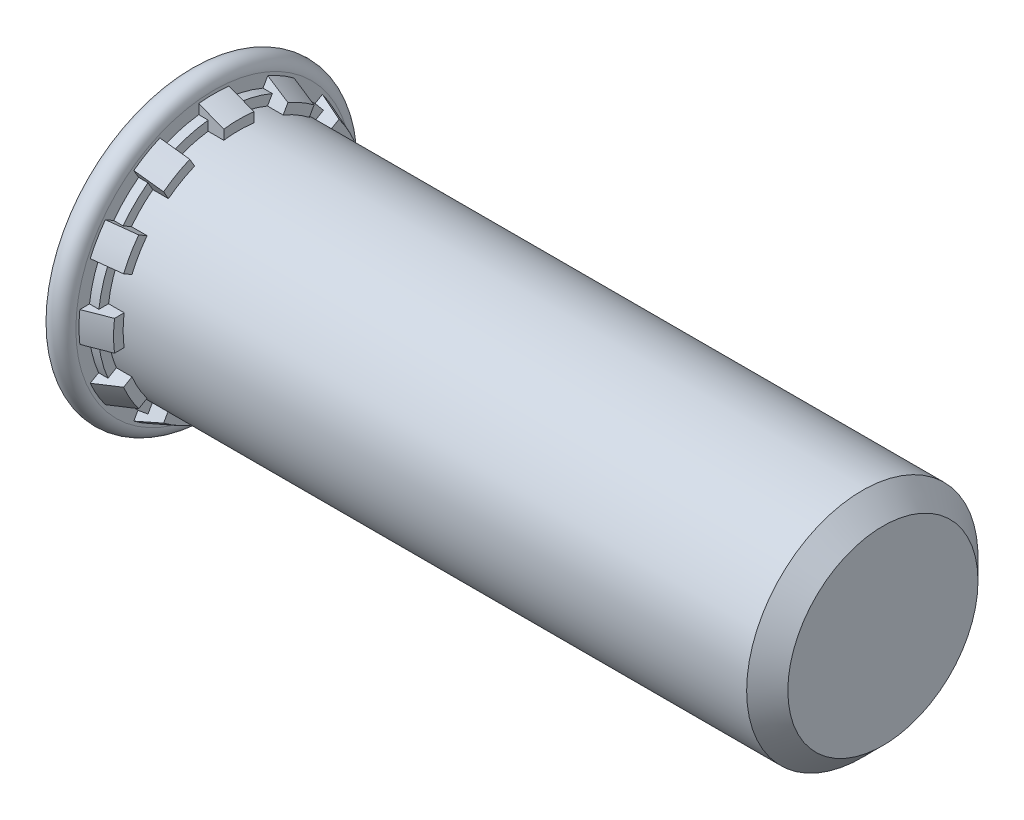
ISO-10303-21;
HEADER;
FILE_DESCRIPTION(('STEP AP214'),'2;1');
FILE_NAME('part.step','',(''),(''),'','','');
FILE_SCHEMA(('AUTOMOTIVE_DESIGN { 1 0 10303 214 1 1 1 1 }'));
ENDSEC;
DATA;
#1=APPLICATION_CONTEXT('core data for automotive mechanical design processes');
#2=APPLICATION_PROTOCOL_DEFINITION('international standard','automotive_design',2000,#1);
#3=PRODUCT_CONTEXT('',#1,'mechanical');
#4=PRODUCT('Part','Part','',(#3));
#5=PRODUCT_RELATED_PRODUCT_CATEGORY('part','',(#4));
#6=PRODUCT_DEFINITION_FORMATION('','',#4);
#7=PRODUCT_DEFINITION_CONTEXT('part definition',#1,'design');
#8=PRODUCT_DEFINITION('design','',#6,#7);
#9=PRODUCT_DEFINITION_SHAPE('','',#8);
#10=(LENGTH_UNIT() NAMED_UNIT(*) SI_UNIT(.MILLI.,.METRE.));
#11=(NAMED_UNIT(*) PLANE_ANGLE_UNIT() SI_UNIT($,.RADIAN.));
#12=(NAMED_UNIT(*) SI_UNIT($,.STERADIAN.) SOLID_ANGLE_UNIT());
#13=UNCERTAINTY_MEASURE_WITH_UNIT(LENGTH_MEASURE(1.E-05),#10,'distance_accuracy_value','');
#14=(GEOMETRIC_REPRESENTATION_CONTEXT(3) GLOBAL_UNCERTAINTY_ASSIGNED_CONTEXT((#13)) GLOBAL_UNIT_ASSIGNED_CONTEXT((#10,
#11,#12)) REPRESENTATION_CONTEXT('',''));
#15=CARTESIAN_POINT('',(0.,0.,0.));
#16=DIRECTION('',(0.,0.,1.));
#17=DIRECTION('',(1.,0.,0.));
#18=AXIS2_PLACEMENT_3D('',#15,#16,#17);
#19=CARTESIAN_POINT('',(0.54,0.,0.));
#20=DIRECTION('',(-1.,0.,0.));
#21=DIRECTION('',(0.,0.,1.));
#22=AXIS2_PLACEMENT_3D('',#19,#20,#21);
#23=CONICAL_SURFACE('',#22,2.915,0.366863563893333);
#24=CARTESIAN_POINT('',(0.54,0.,0.));
#25=DIRECTION('',(-1.,0.,0.));
#26=DIRECTION('',(0.,0.,1.));
#27=AXIS2_PLACEMENT_3D('',#24,#25,#26);
#28=CIRCLE('',#27,2.915);
#29=CARTESIAN_POINT('',(0.54,1.73093647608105,-2.34543896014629));
#30=VERTEX_POINT('',#29);
#31=CARTESIAN_POINT('',(0.54,1.16574148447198,-2.67175444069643));
#32=VERTEX_POINT('',#31);
#33=EDGE_CURVE('E1044',#30,#32,#28,.T.);
#34=ORIENTED_EDGE('',*,*,#33,.F.);
#35=CARTESIAN_POINT('',(1.0802,1.6264407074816,-2.16444697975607));
#36=CARTESIAN_POINT('',(0.967571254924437,1.64823840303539,-2.20220169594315));
#37=CARTESIAN_POINT('',(0.854937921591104,1.67003016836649,-2.23994614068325));
#38=CARTESIAN_POINT('',(0.674801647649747,1.70487118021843,-2.30029254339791));
#39=CARTESIAN_POINT('',(0.607301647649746,1.71792422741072,-2.32290108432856));
#40=CARTESIAN_POINT('',(0.5398,1.73097514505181,-2.34550593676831));
#41=B_SPLINE_CURVE_WITH_KNOTS('',3,(#35,#36,#37,#38,#39,#40),.UNSPECIFIED.,.F.,.F.,(4,2,4),(0.,
0.362314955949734,0.579432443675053),.UNSPECIFIED.);
#42=CARTESIAN_POINT('',(1.08,1.62647941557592,-2.1645140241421));
#43=VERTEX_POINT('',#42);
#44=EDGE_CURVE('E655',#43,#30,#41,.T.);
#45=ORIENTED_EDGE('',*,*,#44,.F.);
#46=CARTESIAN_POINT('',(1.08,0.,0.));
#47=DIRECTION('',(-1.,0.,0.));
#48=DIRECTION('',(0.,0.,1.));
#49=AXIS2_PLACEMENT_3D('',#46,#47,#48);
#50=CIRCLE('',#49,2.7075);
#51=CARTESIAN_POINT('',(1.08,1.06128442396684,-2.49082950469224));
#52=VERTEX_POINT('',#51);
#53=EDGE_CURVE('E1041',#43,#52,#50,.T.);
#54=ORIENTED_EDGE('',*,*,#53,.T.);
#55=CARTESIAN_POINT('',(0.5398,1.16578015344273,-2.67182141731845));
#56=CARTESIAN_POINT('',(0.607301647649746,1.15272923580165,-2.64921656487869));
#57=CARTESIAN_POINT('',(0.674801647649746,1.13967618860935,-2.62660802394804));
#58=CARTESIAN_POINT('',(0.854937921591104,1.10483517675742,-2.56626162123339));
#59=CARTESIAN_POINT('',(0.967571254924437,1.08304341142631,-2.52851717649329));
#60=CARTESIAN_POINT('',(1.0802,1.06124571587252,-2.49076246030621));
#61=B_SPLINE_CURVE_WITH_KNOTS('',3,(#55,#56,#57,#58,#59,#60),.UNSPECIFIED.,.F.,.F.,(4,2,4),(0.,
0.217117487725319,0.579432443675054),.UNSPECIFIED.);
#62=EDGE_CURVE('E695',#32,#52,#61,.T.);
#63=ORIENTED_EDGE('',*,*,#62,.F.);
#64=EDGE_LOOP('',(#34,#45,#54,#63));
#65=FACE_BOUND('',#64,.T.);
#66=ADVANCED_FACE('F32',(#65),#23,.T.);
#67=CARTESIAN_POINT('',(0.54,0.32631548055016,-2.89667796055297));
#68=VERTEX_POINT('',#67);
#69=CARTESIAN_POINT('',(0.54,-0.326315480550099,-2.89667796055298));
#70=VERTEX_POINT('',#69);
#71=EDGE_CURVE('E1271',#68,#70,#28,.T.);
#72=ORIENTED_EDGE('',*,*,#71,.F.);
#73=CARTESIAN_POINT('',(1.7746355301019,0.326315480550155,-2.41866663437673));
#74=CARTESIAN_POINT('',(1.45038277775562,0.326315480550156,-2.54438306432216));
#75=CARTESIAN_POINT('',(1.12607772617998,0.326315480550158,-2.66996445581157));
#76=CARTESIAN_POINT('',(0.477389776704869,0.32631548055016,-2.9209260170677));
#77=CARTESIAN_POINT('',(0.153006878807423,0.326315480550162,-3.04630618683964));
#78=CARTESIAN_POINT('',(-0.275558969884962,0.326315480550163,-3.21185457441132));
#79=CARTESIAN_POINT('',(-0.379718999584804,0.326315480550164,-3.25208215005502));
#80=CARTESIAN_POINT('',(-0.483881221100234,0.326315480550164,-3.29230404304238));
#81=B_SPLINE_CURVE_WITH_KNOTS('',3,(#73,#74,#75,#76,#77,#78,#79,#80),.UNSPECIFIED.,.F.,.F.,(4,2,
2,4),(0.,1.04331203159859,2.0866240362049,2.42159884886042),.UNSPECIFIED.);
#82=CARTESIAN_POINT('',(1.08,0.326315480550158,-2.6877638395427));
#83=VERTEX_POINT('',#82);
#84=EDGE_CURVE('E703',#83,#68,#81,.T.);
#85=ORIENTED_EDGE('',*,*,#84,.F.);
#86=CARTESIAN_POINT('',(1.08,-0.326315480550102,-2.68776383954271));
#87=VERTEX_POINT('',#86);
#88=EDGE_CURVE('E1108',#83,#87,#50,.T.);
#89=ORIENTED_EDGE('',*,*,#88,.T.);
#90=CARTESIAN_POINT('',(-0.483881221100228,-0.326315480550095,-3.29230404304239));
#91=CARTESIAN_POINT('',(-0.379718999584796,-0.326315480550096,-3.25208215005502));
#92=CARTESIAN_POINT('',(-0.27555896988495,-0.326315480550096,-3.21185457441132));
#93=CARTESIAN_POINT('',(0.153006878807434,-0.326315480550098,-3.04630618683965));
#94=CARTESIAN_POINT('',(0.477389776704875,-0.326315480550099,-2.92092601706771));
#95=CARTESIAN_POINT('',(1.12607772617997,-0.326315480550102,-2.66996445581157));
#96=CARTESIAN_POINT('',(1.45038277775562,-0.326315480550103,-2.54438306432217));
#97=CARTESIAN_POINT('',(1.77463553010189,-0.326315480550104,-2.41866663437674));
#98=B_SPLINE_CURVE_WITH_KNOTS('',3,(#90,#91,#92,#93,#94,#95,#96,#97),.UNSPECIFIED.,.F.,.F.,(4,2,
2,4),(0.,0.334974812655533,1.37828681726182,2.4215988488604),.UNSPECIFIED.);
#99=EDGE_CURVE('E731',#70,#87,#98,.T.);
#100=ORIENTED_EDGE('',*,*,#99,.F.);
#101=EDGE_LOOP('',(#72,#85,#89,#100));
#102=FACE_BOUND('',#101,.T.);
#103=ADVANCED_FACE('F1284',(#102),#23,.T.);
#104=CARTESIAN_POINT('',(0.54,-1.16574148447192,-2.67175444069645));
#105=VERTEX_POINT('',#104);
#106=CARTESIAN_POINT('',(0.54,-1.730936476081,-2.34543896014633));
#107=VERTEX_POINT('',#106);
#108=EDGE_CURVE('E1268',#105,#107,#28,.T.);
#109=ORIENTED_EDGE('',*,*,#108,.F.);
#110=CARTESIAN_POINT('',(1.0802,-1.06124571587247,-2.49076246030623));
#111=CARTESIAN_POINT('',(0.967571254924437,-1.08304341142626,-2.52851717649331));
#112=CARTESIAN_POINT('',(0.854937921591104,-1.10483517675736,-2.56626162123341));
#113=CARTESIAN_POINT('',(0.674801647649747,-1.1396761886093,-2.62660802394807));
#114=CARTESIAN_POINT('',(0.607301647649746,-1.15272923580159,-2.64921656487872));
#115=CARTESIAN_POINT('',(0.5398,-1.16578015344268,-2.67182141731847));
#116=B_SPLINE_CURVE_WITH_KNOTS('',3,(#110,#111,#112,#113,#114,#115),.UNSPECIFIED.,.F.,.F.,(4,2,
4),(0.,0.362314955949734,0.579432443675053),.UNSPECIFIED.);
#117=CARTESIAN_POINT('',(1.08,-1.06128442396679,-2.49082950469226));
#118=VERTEX_POINT('',#117);
#119=EDGE_CURVE('E724',#118,#105,#116,.T.);
#120=ORIENTED_EDGE('',*,*,#119,.F.);
#121=CARTESIAN_POINT('',(1.08,-1.62647941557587,-2.16451402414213));
#122=VERTEX_POINT('',#121);
#123=EDGE_CURVE('E1299',#118,#122,#50,.T.);
#124=ORIENTED_EDGE('',*,*,#123,.T.);
#125=CARTESIAN_POINT('',(0.5398,-1.73097514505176,-2.34550593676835));
#126=CARTESIAN_POINT('',(0.607301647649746,-1.71792422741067,-2.32290108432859));
#127=CARTESIAN_POINT('',(0.674801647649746,-1.70487118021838,-2.30029254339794));
#128=CARTESIAN_POINT('',(0.854937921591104,-1.67003016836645,-2.23994614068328));
#129=CARTESIAN_POINT('',(0.967571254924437,-1.64823840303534,-2.20220169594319));
#130=CARTESIAN_POINT('',(1.0802,-1.62644070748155,-2.16444697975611));
#131=B_SPLINE_CURVE_WITH_KNOTS('',3,(#125,#126,#127,#128,#129,#130),.UNSPECIFIED.,.F.,.F.,(4,2,
4),(0.,0.217117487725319,0.579432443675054),.UNSPECIFIED.);
#132=EDGE_CURVE('E758',#107,#122,#131,.T.);
#133=ORIENTED_EDGE('',*,*,#132,.F.);
#134=EDGE_LOOP('',(#109,#120,#124,#133));
#135=FACE_BOUND('',#134,.T.);
#136=ADVANCED_FACE('F1298',(#135),#23,.T.);
#137=CARTESIAN_POINT('',(0.54,-2.3454389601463,-1.73093647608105));
#138=VERTEX_POINT('',#137);
#139=CARTESIAN_POINT('',(0.54,-2.67175444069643,-1.16574148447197));
#140=VERTEX_POINT('',#139);
#141=EDGE_CURVE('E1265',#138,#140,#28,.T.);
#142=ORIENTED_EDGE('',*,*,#141,.F.);
#143=CARTESIAN_POINT('',(1.0802,-2.16444697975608,-1.62644070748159));
#144=CARTESIAN_POINT('',(0.967571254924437,-2.20220169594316,-1.64823840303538));
#145=CARTESIAN_POINT('',(0.854937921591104,-2.23994614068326,-1.67003016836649));
#146=CARTESIAN_POINT('',(0.674801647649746,-2.30029254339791,-1.70487118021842));
#147=CARTESIAN_POINT('',(0.607301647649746,-2.32290108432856,-1.71792422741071));
#148=CARTESIAN_POINT('',(0.5398,-2.34550593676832,-1.7309751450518));
#149=B_SPLINE_CURVE_WITH_KNOTS('',3,(#143,#144,#145,#146,#147,#148),.UNSPECIFIED.,.F.,.F.,(4,2,
4),(0.,0.362314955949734,0.579432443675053),.UNSPECIFIED.);
#150=CARTESIAN_POINT('',(1.08,-2.1645140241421,-1.62647941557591));
#151=VERTEX_POINT('',#150);
#152=EDGE_CURVE('E766',#151,#138,#149,.T.);
#153=ORIENTED_EDGE('',*,*,#152,.F.);
#154=CARTESIAN_POINT('',(1.08,-2.49082950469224,-1.06128442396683));
#155=VERTEX_POINT('',#154);
#156=EDGE_CURVE('E1303',#151,#155,#50,.T.);
#157=ORIENTED_EDGE('',*,*,#156,.T.);
#158=CARTESIAN_POINT('',(0.5398,-2.67182141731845,-1.16578015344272));
#159=CARTESIAN_POINT('',(0.607301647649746,-2.6492165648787,-1.15272923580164));
#160=CARTESIAN_POINT('',(0.674801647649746,-2.62660802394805,-1.13967618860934));
#161=CARTESIAN_POINT('',(0.854937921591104,-2.56626162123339,-1.10483517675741));
#162=CARTESIAN_POINT('',(0.967571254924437,-2.52851717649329,-1.0830434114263));
#163=CARTESIAN_POINT('',(1.0802,-2.49076246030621,-1.06124571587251));
#164=B_SPLINE_CURVE_WITH_KNOTS('',3,(#158,#159,#160,#161,#162,#163),.UNSPECIFIED.,.F.,.F.,(4,2,
4),(0.,0.217117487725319,0.579432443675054),.UNSPECIFIED.);
#165=EDGE_CURVE('E794',#140,#155,#164,.T.);
#166=ORIENTED_EDGE('',*,*,#165,.F.);
#167=EDGE_LOOP('',(#142,#153,#157,#166));
#168=FACE_BOUND('',#167,.T.);
#169=ADVANCED_FACE('F1457',(#168),#23,.T.);
#170=CARTESIAN_POINT('',(0.54,-2.89667796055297,-0.32631548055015));
#171=VERTEX_POINT('',#170);
#172=CARTESIAN_POINT('',(0.54,-2.89667796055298,0.32631548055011));
#173=VERTEX_POINT('',#172);
#174=EDGE_CURVE('E1262',#171,#173,#28,.T.);
#175=ORIENTED_EDGE('',*,*,#174,.F.);
#176=CARTESIAN_POINT('',(1.7746355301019,-2.41866663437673,-0.326315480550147));
#177=CARTESIAN_POINT('',(1.45038277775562,-2.54438306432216,-0.326315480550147));
#178=CARTESIAN_POINT('',(1.12607772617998,-2.66996445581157,-0.326315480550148));
#179=CARTESIAN_POINT('',(0.47738977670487,-2.92092601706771,-0.32631548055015));
#180=CARTESIAN_POINT('',(0.153006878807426,-3.04630618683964,-0.326315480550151));
#181=CARTESIAN_POINT('',(-0.27555896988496,-3.21185457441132,-0.326315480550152));
#182=CARTESIAN_POINT('',(-0.379718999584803,-3.25208215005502,-0.326315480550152));
#183=CARTESIAN_POINT('',(-0.483881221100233,-3.29230404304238,-0.326315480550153));
#184=B_SPLINE_CURVE_WITH_KNOTS('',3,(#176,#177,#178,#179,#180,#181,#182,#183),.UNSPECIFIED.,.F.,
.F.,(4,2,2,4),(0.,1.04331203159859,2.08662403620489,2.42159884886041),.UNSPECIFIED.);
#185=CARTESIAN_POINT('',(1.08,-2.6877638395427,-0.326315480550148));
#186=VERTEX_POINT('',#185);
#187=EDGE_CURVE('E787',#186,#171,#184,.T.);
#188=ORIENTED_EDGE('',*,*,#187,.F.);
#189=CARTESIAN_POINT('',(1.08,-2.68776383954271,0.326315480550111));
#190=VERTEX_POINT('',#189);
#191=EDGE_CURVE('E1304',#186,#190,#50,.T.);
#192=ORIENTED_EDGE('',*,*,#191,.T.);
#193=CARTESIAN_POINT('',(-0.483881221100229,-3.29230404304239,0.326315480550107));
#194=CARTESIAN_POINT('',(-0.379718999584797,-3.25208215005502,0.326315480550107));
#195=CARTESIAN_POINT('',(-0.275558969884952,-3.21185457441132,0.326315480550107));
#196=CARTESIAN_POINT('',(0.153006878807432,-3.04630618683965,0.326315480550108));
#197=CARTESIAN_POINT('',(0.477389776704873,-2.92092601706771,0.326315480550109));
#198=CARTESIAN_POINT('',(1.12607772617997,-2.66996445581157,0.326315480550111));
#199=CARTESIAN_POINT('',(1.45038277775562,-2.54438306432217,0.326315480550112));
#200=CARTESIAN_POINT('',(1.77463553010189,-2.41866663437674,0.326315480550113));
#201=B_SPLINE_CURVE_WITH_KNOTS('',3,(#193,#194,#195,#196,#197,#198,#199,#200),.UNSPECIFIED.,.F.,
.F.,(4,2,2,4),(0.,0.334974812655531,1.37828681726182,2.4215988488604),.UNSPECIFIED.);
#202=EDGE_CURVE('E821',#173,#190,#201,.T.);
#203=ORIENTED_EDGE('',*,*,#202,.F.);
#204=EDGE_LOOP('',(#175,#188,#192,#203));
#205=FACE_BOUND('',#204,.T.);
#206=ADVANCED_FACE('F1454',(#205),#23,.T.);
#207=CARTESIAN_POINT('',(0.54,-2.67175444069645,1.16574148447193));
#208=VERTEX_POINT('',#207);
#209=CARTESIAN_POINT('',(0.54,-2.34543896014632,1.73093647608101));
#210=VERTEX_POINT('',#209);
#211=EDGE_CURVE('E1259',#208,#210,#28,.T.);
#212=ORIENTED_EDGE('',*,*,#211,.F.);
#213=CARTESIAN_POINT('',(1.0802,-2.49076246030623,1.06124571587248));
#214=CARTESIAN_POINT('',(0.967571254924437,-2.52851717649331,1.08304341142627));
#215=CARTESIAN_POINT('',(0.854937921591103,-2.5662616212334,1.10483517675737));
#216=CARTESIAN_POINT('',(0.674801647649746,-2.62660802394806,1.13967618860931));
#217=CARTESIAN_POINT('',(0.607301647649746,-2.64921656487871,1.1527292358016));
#218=CARTESIAN_POINT('',(0.5398,-2.67182141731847,1.16578015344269));
#219=B_SPLINE_CURVE_WITH_KNOTS('',3,(#213,#214,#215,#216,#217,#218),.UNSPECIFIED.,.F.,.F.,(4,2,
4),(0.,0.362314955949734,0.579432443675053),.UNSPECIFIED.);
#220=CARTESIAN_POINT('',(1.08,-2.49082950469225,1.0612844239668));
#221=VERTEX_POINT('',#220);
#222=EDGE_CURVE('E829',#221,#208,#219,.T.);
#223=ORIENTED_EDGE('',*,*,#222,.F.);
#224=CARTESIAN_POINT('',(1.08,-2.16451402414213,1.62647941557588));
#225=VERTEX_POINT('',#224);
#226=EDGE_CURVE('E1309',#221,#225,#50,.T.);
#227=ORIENTED_EDGE('',*,*,#226,.T.);
#228=CARTESIAN_POINT('',(0.5398,-2.34550593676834,1.73097514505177));
#229=CARTESIAN_POINT('',(0.607301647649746,-2.32290108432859,1.71792422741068));
#230=CARTESIAN_POINT('',(0.674801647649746,-2.30029254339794,1.70487118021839));
#231=CARTESIAN_POINT('',(0.854937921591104,-2.23994614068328,1.67003016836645));
#232=CARTESIAN_POINT('',(0.967571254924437,-2.20220169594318,1.64823840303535));
#233=CARTESIAN_POINT('',(1.0802,-2.1644469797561,1.62644070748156));
#234=B_SPLINE_CURVE_WITH_KNOTS('',3,(#228,#229,#230,#231,#232,#233),.UNSPECIFIED.,.F.,.F.,(4,2,
4),(0.,0.217117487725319,0.579432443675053),.UNSPECIFIED.);
#235=EDGE_CURVE('E857',#210,#225,#234,.T.);
#236=ORIENTED_EDGE('',*,*,#235,.F.);
#237=EDGE_LOOP('',(#212,#223,#227,#236));
#238=FACE_BOUND('',#237,.T.);
#239=ADVANCED_FACE('F1456',(#238),#23,.T.);
#240=CARTESIAN_POINT('',(0.54,-1.73093647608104,2.3454389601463));
#241=VERTEX_POINT('',#240);
#242=CARTESIAN_POINT('',(0.54,-1.16574148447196,2.67175444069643));
#243=VERTEX_POINT('',#242);
#244=EDGE_CURVE('E1256',#241,#243,#28,.T.);
#245=ORIENTED_EDGE('',*,*,#244,.F.);
#246=CARTESIAN_POINT('',(1.0802,-1.62644070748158,2.16444697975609));
#247=CARTESIAN_POINT('',(0.967571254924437,-1.64823840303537,2.20220169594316));
#248=CARTESIAN_POINT('',(0.854937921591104,-1.67003016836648,2.23994614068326));
#249=CARTESIAN_POINT('',(0.674801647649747,-1.70487118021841,2.30029254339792));
#250=CARTESIAN_POINT('',(0.607301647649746,-1.71792422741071,2.32290108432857));
#251=CARTESIAN_POINT('',(0.5398,-1.73097514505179,2.34550593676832));
#252=B_SPLINE_CURVE_WITH_KNOTS('',3,(#246,#247,#248,#249,#250,#251),.UNSPECIFIED.,.F.,.F.,(4,2,
4),(0.,0.362314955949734,0.579432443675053),.UNSPECIFIED.);
#253=CARTESIAN_POINT('',(1.08,-1.6264794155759,2.16451402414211));
#254=VERTEX_POINT('',#253);
#255=EDGE_CURVE('E850',#254,#241,#252,.T.);
#256=ORIENTED_EDGE('',*,*,#255,.F.);
#257=CARTESIAN_POINT('',(1.08,-1.06128442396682,2.49082950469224));
#258=VERTEX_POINT('',#257);
#259=EDGE_CURVE('E1313',#254,#258,#50,.T.);
#260=ORIENTED_EDGE('',*,*,#259,.T.);
#261=CARTESIAN_POINT('',(0.539799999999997,-1.16578015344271,2.67182141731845));
#262=CARTESIAN_POINT('',(0.607301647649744,-1.15272923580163,2.6492165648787));
#263=CARTESIAN_POINT('',(0.674801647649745,-1.13967618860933,2.62660802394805));
#264=CARTESIAN_POINT('',(0.854937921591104,-1.1048351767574,2.56626162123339));
#265=CARTESIAN_POINT('',(0.967571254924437,-1.08304341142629,2.5285171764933));
#266=CARTESIAN_POINT('',(1.0802,-1.0612457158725,2.49076246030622));
#267=B_SPLINE_CURVE_WITH_KNOTS('',3,(#261,#262,#263,#264,#265,#266),.UNSPECIFIED.,.F.,.F.,(4,2,
4),(0.,0.217117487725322,0.579432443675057),.UNSPECIFIED.);
#268=EDGE_CURVE('E884',#243,#258,#267,.T.);
#269=ORIENTED_EDGE('',*,*,#268,.F.);
#270=EDGE_LOOP('',(#245,#256,#260,#269));
#271=FACE_BOUND('',#270,.T.);
#272=ADVANCED_FACE('F1370',(#271),#23,.T.);
#273=CARTESIAN_POINT('',(0.54,-0.32631548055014,2.89667796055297));
#274=VERTEX_POINT('',#273);
#275=CARTESIAN_POINT('',(0.54,0.32631548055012,2.89667796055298));
#276=VERTEX_POINT('',#275);
#277=EDGE_CURVE('E1253',#274,#276,#28,.T.);
#278=ORIENTED_EDGE('',*,*,#277,.F.);
#279=CARTESIAN_POINT('',(1.99477802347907,-0.326315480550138,2.33328052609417));
#280=CARTESIAN_POINT('',(1.67055267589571,-0.326315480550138,2.45906765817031));
#281=CARTESIAN_POINT('',(1.3462698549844,-0.326315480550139,2.58470645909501));
#282=CARTESIAN_POINT('',(0.697618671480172,-0.32631548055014,2.83576304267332));
#283=CARTESIAN_POINT('',(0.373250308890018,-0.32631548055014,2.96118082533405));
#284=CARTESIAN_POINT('',(-0.128716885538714,-0.326315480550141,3.15513834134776));
#285=CARTESIAN_POINT('',(-0.306296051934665,-0.326315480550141,3.22372897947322));
#286=CARTESIAN_POINT('',(-0.483881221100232,-0.326315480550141,3.29230404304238));
#287=B_SPLINE_CURVE_WITH_KNOTS('',3,(#279,#280,#281,#282,#283,#284,#285,#286),.UNSPECIFIED.,.F.,
.F.,(4,2,2,4),(0.,1.04331204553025,2.08662405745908,2.6577206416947),.UNSPECIFIED.);
#288=CARTESIAN_POINT('',(1.08,-0.326315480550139,2.6877638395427));
#289=VERTEX_POINT('',#288);
#290=EDGE_CURVE('E892',#289,#274,#287,.T.);
#291=ORIENTED_EDGE('',*,*,#290,.F.);
#292=CARTESIAN_POINT('',(1.08,0.32631548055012,2.68776383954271));
#293=VERTEX_POINT('',#292);
#294=EDGE_CURVE('E1215',#289,#293,#50,.T.);
#295=ORIENTED_EDGE('',*,*,#294,.T.);
#296=CARTESIAN_POINT('',(-0.48388122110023,0.326315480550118,3.29230404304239));
#297=CARTESIAN_POINT('',(-0.306296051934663,0.326315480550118,3.22372897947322));
#298=CARTESIAN_POINT('',(-0.128716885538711,0.326315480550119,3.15513834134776));
#299=CARTESIAN_POINT('',(0.37325030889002,0.326315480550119,2.96118082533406));
#300=CARTESIAN_POINT('',(0.697618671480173,0.32631548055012,2.83576304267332));
#301=CARTESIAN_POINT('',(1.3462698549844,0.326315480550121,2.58470645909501));
#302=CARTESIAN_POINT('',(1.67055267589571,0.326315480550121,2.45906765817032));
#303=CARTESIAN_POINT('',(1.99477802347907,0.326315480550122,2.33328052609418));
#304=B_SPLINE_CURVE_WITH_KNOTS('',3,(#296,#297,#298,#299,#300,#301,#302,#303),.UNSPECIFIED.,.F.,
.F.,(4,2,2,4),(0.,0.571096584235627,1.61440859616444,2.65772064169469),.UNSPECIFIED.);
#305=EDGE_CURVE('E920',#276,#293,#304,.T.);
#306=ORIENTED_EDGE('',*,*,#305,.F.);
#307=EDGE_LOOP('',(#278,#291,#295,#306));
#308=FACE_BOUND('',#307,.T.);
#309=ADVANCED_FACE('F1325',(#308),#23,.T.);
#310=CARTESIAN_POINT('',(0.54,1.16574148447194,2.67175444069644));
#311=VERTEX_POINT('',#310);
#312=CARTESIAN_POINT('',(0.54,1.73093647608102,2.34543896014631));
#313=VERTEX_POINT('',#312);
#314=EDGE_CURVE('E1252',#311,#313,#28,.T.);
#315=ORIENTED_EDGE('',*,*,#314,.F.);
#316=CARTESIAN_POINT('',(1.0802,1.06124571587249,2.49076246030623));
#317=CARTESIAN_POINT('',(0.967571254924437,1.08304341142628,2.5285171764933));
#318=CARTESIAN_POINT('',(0.854937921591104,1.10483517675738,2.5662616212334));
#319=CARTESIAN_POINT('',(0.674801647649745,1.13967618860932,2.62660802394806));
#320=CARTESIAN_POINT('',(0.607301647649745,1.15272923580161,2.64921656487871));
#321=CARTESIAN_POINT('',(0.539799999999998,1.1657801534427,2.67182141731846));
#322=B_SPLINE_CURVE_WITH_KNOTS('',3,(#316,#317,#318,#319,#320,#321),.UNSPECIFIED.,.F.,.F.,(4,2,
4),(0.,0.362314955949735,0.579432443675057),.UNSPECIFIED.);
#323=CARTESIAN_POINT('',(1.08,1.06128442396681,2.49082950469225));
#324=VERTEX_POINT('',#323);
#325=EDGE_CURVE('E913',#324,#311,#322,.T.);
#326=ORIENTED_EDGE('',*,*,#325,.F.);
#327=CARTESIAN_POINT('',(1.08,1.62647941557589,2.16451402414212));
#328=VERTEX_POINT('',#327);
#329=EDGE_CURVE('E1214',#324,#328,#50,.T.);
#330=ORIENTED_EDGE('',*,*,#329,.T.);
#331=CARTESIAN_POINT('',(0.5398,1.73097514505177,2.34550593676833));
#332=CARTESIAN_POINT('',(0.607301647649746,1.71792422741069,2.32290108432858));
#333=CARTESIAN_POINT('',(0.674801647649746,1.7048711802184,2.30029254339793));
#334=CARTESIAN_POINT('',(0.854937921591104,1.67003016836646,2.23994614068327));
#335=CARTESIAN_POINT('',(0.967571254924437,1.64823840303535,2.20220169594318));
#336=CARTESIAN_POINT('',(1.0802,1.62644070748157,2.1644469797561));
#337=B_SPLINE_CURVE_WITH_KNOTS('',3,(#331,#332,#333,#334,#335,#336),.UNSPECIFIED.,.F.,.F.,(4,2,
4),(0.,0.217117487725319,0.579432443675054),.UNSPECIFIED.);
#338=EDGE_CURVE('E947',#313,#328,#337,.T.);
#339=ORIENTED_EDGE('',*,*,#338,.F.);
#340=EDGE_LOOP('',(#315,#326,#330,#339));
#341=FACE_BOUND('',#340,.T.);
#342=ADVANCED_FACE('F1362',(#341),#23,.T.);
#343=CARTESIAN_POINT('',(0.54,2.34543896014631,1.73093647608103));
#344=VERTEX_POINT('',#343);
#345=CARTESIAN_POINT('',(0.54,2.67175444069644,1.16574148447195));
#346=VERTEX_POINT('',#345);
#347=EDGE_CURVE('E1249',#344,#346,#28,.T.);
#348=ORIENTED_EDGE('',*,*,#347,.F.);
#349=CARTESIAN_POINT('',(1.0802,2.16444697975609,1.62644070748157));
#350=CARTESIAN_POINT('',(0.967571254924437,2.20220169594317,1.64823840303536));
#351=CARTESIAN_POINT('',(0.854937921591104,2.23994614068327,1.67003016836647));
#352=CARTESIAN_POINT('',(0.674801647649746,2.30029254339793,1.7048711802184));
#353=CARTESIAN_POINT('',(0.607301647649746,2.32290108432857,1.7179242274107));
#354=CARTESIAN_POINT('',(0.5398,2.34550593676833,1.73097514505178));
#355=B_SPLINE_CURVE_WITH_KNOTS('',3,(#349,#350,#351,#352,#353,#354),.UNSPECIFIED.,.F.,.F.,(4,2,
4),(0.,0.362314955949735,0.579432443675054),.UNSPECIFIED.);
#356=CARTESIAN_POINT('',(1.08,2.16451402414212,1.62647941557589));
#357=VERTEX_POINT('',#356);
#358=EDGE_CURVE('E955',#357,#344,#355,.T.);
#359=ORIENTED_EDGE('',*,*,#358,.F.);
#360=CARTESIAN_POINT('',(1.08,2.49082950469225,1.06128442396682));
#361=VERTEX_POINT('',#360);
#362=EDGE_CURVE('E1211',#357,#361,#50,.T.);
#363=ORIENTED_EDGE('',*,*,#362,.T.);
#364=CARTESIAN_POINT('',(0.539799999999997,2.67182141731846,1.1657801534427));
#365=CARTESIAN_POINT('',(0.607301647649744,2.64921656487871,1.15272923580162));
#366=CARTESIAN_POINT('',(0.674801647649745,2.62660802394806,1.13967618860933));
#367=CARTESIAN_POINT('',(0.854937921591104,2.5662616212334,1.10483517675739));
#368=CARTESIAN_POINT('',(0.967571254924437,2.5285171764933,1.08304341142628));
#369=CARTESIAN_POINT('',(1.0802,2.49076246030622,1.0612457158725));
#370=B_SPLINE_CURVE_WITH_KNOTS('',3,(#364,#365,#366,#367,#368,#369),.UNSPECIFIED.,.F.,.F.,(4,2,
4),(0.,0.217117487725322,0.579432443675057),.UNSPECIFIED.);
#371=EDGE_CURVE('E983',#346,#361,#370,.T.);
#372=ORIENTED_EDGE('',*,*,#371,.F.);
#373=EDGE_LOOP('',(#348,#359,#363,#372));
#374=FACE_BOUND('',#373,.T.);
#375=ADVANCED_FACE('F1251',(#374),#23,.T.);
#376=CARTESIAN_POINT('',(0.54,2.89667796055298,0.326315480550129));
#377=VERTEX_POINT('',#376);
#378=CARTESIAN_POINT('',(0.54,2.89667796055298,-0.32631548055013));
#379=VERTEX_POINT('',#378);
#380=EDGE_CURVE('E1040',#377,#379,#28,.T.);
#381=ORIENTED_EDGE('',*,*,#380,.F.);
#382=CARTESIAN_POINT('',(1.99477802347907,2.33328052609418,0.32631548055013));
#383=CARTESIAN_POINT('',(1.67055267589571,2.45906765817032,0.326315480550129));
#384=CARTESIAN_POINT('',(1.3462698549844,2.58470645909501,0.32631548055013));
#385=CARTESIAN_POINT('',(0.697618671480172,2.83576304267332,0.32631548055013));
#386=CARTESIAN_POINT('',(0.373250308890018,2.96118082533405,0.32631548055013));
#387=CARTESIAN_POINT('',(-0.128716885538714,3.15513834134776,0.32631548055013));
#388=CARTESIAN_POINT('',(-0.306296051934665,3.22372897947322,0.32631548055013));
#389=CARTESIAN_POINT('',(-0.483881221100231,3.29230404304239,0.326315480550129));
#390=B_SPLINE_CURVE_WITH_KNOTS('',3,(#382,#383,#384,#385,#386,#387,#388,#389),.UNSPECIFIED.,.F.,
.F.,(4,2,2,4),(0.,1.04331204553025,2.08662405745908,2.6577206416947),.UNSPECIFIED.);
#391=CARTESIAN_POINT('',(1.08,2.6877638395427,0.32631548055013));
#392=VERTEX_POINT('',#391);
#393=EDGE_CURVE('E976',#392,#377,#390,.T.);
#394=ORIENTED_EDGE('',*,*,#393,.F.);
#395=CARTESIAN_POINT('',(1.08,2.6877638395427,-0.32631548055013));
#396=VERTEX_POINT('',#395);
#397=EDGE_CURVE('E1036',#392,#396,#50,.T.);
#398=ORIENTED_EDGE('',*,*,#397,.T.);
#399=CARTESIAN_POINT('',(-0.483881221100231,3.29230404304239,-0.32631548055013));
#400=CARTESIAN_POINT('',(-0.306296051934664,3.22372897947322,-0.32631548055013));
#401=CARTESIAN_POINT('',(-0.128716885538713,3.15513834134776,-0.32631548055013));
#402=CARTESIAN_POINT('',(0.373250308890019,2.96118082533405,-0.32631548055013));
#403=CARTESIAN_POINT('',(0.697618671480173,2.83576304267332,-0.32631548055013));
#404=CARTESIAN_POINT('',(1.3462698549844,2.58470645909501,-0.32631548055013));
#405=CARTESIAN_POINT('',(1.67055267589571,2.45906765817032,-0.32631548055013));
#406=CARTESIAN_POINT('',(1.99477802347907,2.33328052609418,-0.32631548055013));
#407=B_SPLINE_CURVE_WITH_KNOTS('',3,(#399,#400,#401,#402,#403,#404,#405,#406),.UNSPECIFIED.,.F.,
.F.,(4,2,2,4),(0.,0.571096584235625,1.61440859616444,2.6577206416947),.UNSPECIFIED.);
#408=EDGE_CURVE('E1014',#379,#396,#407,.T.);
#409=ORIENTED_EDGE('',*,*,#408,.F.);
#410=EDGE_LOOP('',(#381,#394,#398,#409));
#411=FACE_BOUND('',#410,.T.);
#412=ADVANCED_FACE('F1219',(#411),#23,.T.);
#413=CARTESIAN_POINT('',(1.08,2.7075,0.));
#414=DIRECTION('',(1.,0.,0.));
#415=DIRECTION('',(0.,0.,-1.));
#416=AXIS2_PLACEMENT_3D('',#413,#414,#415);
#417=PLANE('',#416);
#418=DIRECTION('',(0.,-0.866025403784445,0.499999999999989));
#419=VECTOR('',#418,1.);
#420=CARTESIAN_POINT('',(1.08,1.98338335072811,-1.52190357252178));
#421=LINE('',#420,#419);
#422=CARTESIAN_POINT('',(1.08,2.16451402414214,-1.62647941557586));
#423=VERTEX_POINT('',#422);
#424=CARTESIAN_POINT('',(1.08,1.98338335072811,-1.52190357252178));
#425=VERTEX_POINT('',#424);
#426=EDGE_CURVE('E647',#423,#425,#421,.T.);
#427=ORIENTED_EDGE('',*,*,#426,.F.);
#428=CARTESIAN_POINT('',(1.08,2.49082950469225,-1.06128442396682));
#429=VERTEX_POINT('',#428);
#430=EDGE_CURVE('E1037',#429,#423,#50,.T.);
#431=ORIENTED_EDGE('',*,*,#430,.F.);
#432=DIRECTION('',(0.,0.866025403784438,-0.500000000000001));
#433=VECTOR('',#432,1.);
#434=CARTESIAN_POINT('',(1.08,2.30969883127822,-0.956708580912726));
#435=LINE('',#434,#433);
#436=CARTESIAN_POINT('',(1.08,2.30969883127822,-0.956708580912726));
#437=VERTEX_POINT('',#436);
#438=EDGE_CURVE('E1175',#437,#429,#435,.T.);
#439=ORIENTED_EDGE('',*,*,#438,.F.);
#440=CARTESIAN_POINT('',(1.08,0.,0.));
#441=DIRECTION('',(-1.,0.,0.));
#442=DIRECTION('',(0.,0.,1.));
#443=AXIS2_PLACEMENT_3D('',#440,#441,#442);
#444=CIRCLE('',#443,2.5);
#445=EDGE_CURVE('E1033',#437,#425,#444,.T.);
#446=ORIENTED_EDGE('',*,*,#445,.T.);
#447=EDGE_LOOP('',(#427,#431,#439,#446));
#448=FACE_BOUND('',#447,.T.);
#449=ADVANCED_FACE('F1352',(#448),#417,.T.);
#450=DIRECTION('',(0.,0.50000000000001,-0.866025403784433));
#451=VECTOR('',#450,1.);
#452=CARTESIAN_POINT('',(1.08,1.52190357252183,-1.98338335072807));
#453=LINE('',#452,#451);
#454=CARTESIAN_POINT('',(1.08,1.52190357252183,-1.98338335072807));
#455=VERTEX_POINT('',#454);
#456=EDGE_CURVE('E641',#455,#43,#453,.T.);
#457=ORIENTED_EDGE('',*,*,#456,.F.);
#458=CARTESIAN_POINT('',(1.08,0.956708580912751,-2.30969883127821));
#459=VERTEX_POINT('',#458);
#460=EDGE_CURVE('E55',#455,#459,#444,.T.);
#461=ORIENTED_EDGE('',*,*,#460,.T.);
#462=DIRECTION('',(0.,-0.50000000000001,0.866025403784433));
#463=VECTOR('',#462,1.);
#464=CARTESIAN_POINT('',(1.08,0.956708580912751,-2.30969883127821));
#465=LINE('',#464,#463);
#466=EDGE_CURVE('E1093',#52,#459,#465,.T.);
#467=ORIENTED_EDGE('',*,*,#466,.F.);
#468=ORIENTED_EDGE('',*,*,#53,.F.);
#469=EDGE_LOOP('',(#457,#461,#467,#468));
#470=FACE_BOUND('',#469,.T.);
#471=ADVANCED_FACE('F1360',(#470),#417,.T.);
#472=DIRECTION('',(0.,0.,-1.));
#473=VECTOR('',#472,1.);
#474=CARTESIAN_POINT('',(1.08,0.326315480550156,-2.47861215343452));
#475=LINE('',#474,#473);
#476=CARTESIAN_POINT('',(1.08,0.326315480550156,-2.47861215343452));
#477=VERTEX_POINT('',#476);
#478=EDGE_CURVE('E1095',#477,#83,#475,.T.);
#479=ORIENTED_EDGE('',*,*,#478,.F.);
#480=CARTESIAN_POINT('',(1.08,-0.326315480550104,-2.47861215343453));
#481=VERTEX_POINT('',#480);
#482=EDGE_CURVE('E1107',#477,#481,#444,.T.);
#483=ORIENTED_EDGE('',*,*,#482,.T.);
#484=DIRECTION('',(0.,0.,1.));
#485=VECTOR('',#484,1.);
#486=CARTESIAN_POINT('',(1.08,-0.326315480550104,-2.47861215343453));
#487=LINE('',#486,#485);
#488=EDGE_CURVE('E712',#87,#481,#487,.T.);
#489=ORIENTED_EDGE('',*,*,#488,.F.);
#490=ORIENTED_EDGE('',*,*,#88,.F.);
#491=EDGE_LOOP('',(#479,#483,#489,#490));
#492=FACE_BOUND('',#491,.T.);
#493=ADVANCED_FACE('F1105',(#492),#417,.T.);
#494=DIRECTION('',(0.,-0.499999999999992,-0.866025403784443));
#495=VECTOR('',#494,1.);
#496=CARTESIAN_POINT('',(1.08,-0.956708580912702,-2.30969883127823));
#497=LINE('',#496,#495);
#498=CARTESIAN_POINT('',(1.08,-0.956708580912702,-2.30969883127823));
#499=VERTEX_POINT('',#498);
#500=EDGE_CURVE('E702',#499,#118,#497,.T.);
#501=ORIENTED_EDGE('',*,*,#500,.F.);
#502=CARTESIAN_POINT('',(1.08,-1.52190357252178,-1.9833833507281));
#503=VERTEX_POINT('',#502);
#504=EDGE_CURVE('E1112',#499,#503,#444,.T.);
#505=ORIENTED_EDGE('',*,*,#504,.T.);
#506=DIRECTION('',(0.,0.499999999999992,0.866025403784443));
#507=VECTOR('',#506,1.);
#508=CARTESIAN_POINT('',(1.08,-1.52190357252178,-1.9833833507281));
#509=LINE('',#508,#507);
#510=EDGE_CURVE('E1302',#122,#503,#509,.T.);
#511=ORIENTED_EDGE('',*,*,#510,.F.);
#512=ORIENTED_EDGE('',*,*,#123,.F.);
#513=EDGE_LOOP('',(#501,#505,#511,#512));
#514=FACE_BOUND('',#513,.T.);
#515=ADVANCED_FACE('F1300',(#514),#417,.T.);
#516=DIRECTION('',(0.,-0.866025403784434,-0.500000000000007));
#517=VECTOR('',#516,1.);
#518=CARTESIAN_POINT('',(1.08,-1.98338335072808,-1.52190357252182));
#519=LINE('',#518,#517);
#520=CARTESIAN_POINT('',(1.08,-1.98338335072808,-1.52190357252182));
#521=VERTEX_POINT('',#520);
#522=EDGE_CURVE('E1288',#521,#151,#519,.T.);
#523=ORIENTED_EDGE('',*,*,#522,.F.);
#524=CARTESIAN_POINT('',(1.08,-2.30969883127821,-0.956708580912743));
#525=VERTEX_POINT('',#524);
#526=EDGE_CURVE('E1113',#521,#525,#444,.T.);
#527=ORIENTED_EDGE('',*,*,#526,.T.);
#528=DIRECTION('',(0.,0.866025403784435,0.500000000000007));
#529=VECTOR('',#528,1.);
#530=CARTESIAN_POINT('',(1.08,-2.30969883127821,-0.956708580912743));
#531=LINE('',#530,#529);
#532=EDGE_CURVE('E775',#155,#525,#531,.T.);
#533=ORIENTED_EDGE('',*,*,#532,.F.);
#534=ORIENTED_EDGE('',*,*,#156,.F.);
#535=EDGE_LOOP('',(#523,#527,#533,#534));
#536=FACE_BOUND('',#535,.T.);
#537=ADVANCED_FACE('F1401',(#536),#417,.T.);
#538=DIRECTION('',(0.,-1.,0.));
#539=VECTOR('',#538,1.);
#540=CARTESIAN_POINT('',(1.08,-2.47861215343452,-0.326315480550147));
#541=LINE('',#540,#539);
#542=CARTESIAN_POINT('',(1.08,-2.47861215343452,-0.326315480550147));
#543=VERTEX_POINT('',#542);
#544=EDGE_CURVE('E765',#543,#186,#541,.T.);
#545=ORIENTED_EDGE('',*,*,#544,.F.);
#546=CARTESIAN_POINT('',(1.08,-2.47861215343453,0.326315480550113));
#547=VERTEX_POINT('',#546);
#548=EDGE_CURVE('E1119',#543,#547,#444,.T.);
#549=ORIENTED_EDGE('',*,*,#548,.T.);
#550=DIRECTION('',(0.,1.,0.));
#551=VECTOR('',#550,1.);
#552=CARTESIAN_POINT('',(1.08,-2.47861215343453,0.326315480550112));
#553=LINE('',#552,#551);
#554=EDGE_CURVE('E1421',#190,#547,#553,.T.);
#555=ORIENTED_EDGE('',*,*,#554,.F.);
#556=ORIENTED_EDGE('',*,*,#191,.F.);
#557=EDGE_LOOP('',(#545,#549,#555,#556));
#558=FACE_BOUND('',#557,.T.);
#559=ADVANCED_FACE('F1405',(#558),#417,.T.);
#560=DIRECTION('',(0.,-0.866025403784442,0.499999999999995));
#561=VECTOR('',#560,1.);
#562=CARTESIAN_POINT('',(1.08,-2.30969883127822,0.95670858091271));
#563=LINE('',#562,#561);
#564=CARTESIAN_POINT('',(1.08,-2.30969883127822,0.95670858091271));
#565=VERTEX_POINT('',#564);
#566=EDGE_CURVE('E1420',#565,#221,#563,.T.);
#567=ORIENTED_EDGE('',*,*,#566,.F.);
#568=CARTESIAN_POINT('',(1.08,-1.9833833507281,1.52190357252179));
#569=VERTEX_POINT('',#568);
#570=EDGE_CURVE('E1124',#565,#569,#444,.T.);
#571=ORIENTED_EDGE('',*,*,#570,.T.);
#572=DIRECTION('',(0.,0.866025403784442,-0.499999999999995));
#573=VECTOR('',#572,1.);
#574=CARTESIAN_POINT('',(1.08,-1.9833833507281,1.52190357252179));
#575=LINE('',#574,#573);
#576=EDGE_CURVE('E838',#225,#569,#575,.T.);
#577=ORIENTED_EDGE('',*,*,#576,.F.);
#578=ORIENTED_EDGE('',*,*,#226,.F.);
#579=EDGE_LOOP('',(#567,#571,#577,#578));
#580=FACE_BOUND('',#579,.T.);
#581=ADVANCED_FACE('F1340',(#580),#417,.T.);
#582=DIRECTION('',(0.,-0.500000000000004,0.866025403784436));
#583=VECTOR('',#582,1.);
#584=CARTESIAN_POINT('',(1.08,-1.52190357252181,1.98338335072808));
#585=LINE('',#584,#583);
#586=CARTESIAN_POINT('',(1.08,-1.52190357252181,1.98338335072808));
#587=VERTEX_POINT('',#586);
#588=EDGE_CURVE('E828',#587,#254,#585,.T.);
#589=ORIENTED_EDGE('',*,*,#588,.F.);
#590=CARTESIAN_POINT('',(1.08,-0.956708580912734,2.30969883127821));
#591=VERTEX_POINT('',#590);
#592=EDGE_CURVE('E1130',#587,#591,#444,.T.);
#593=ORIENTED_EDGE('',*,*,#592,.T.);
#594=DIRECTION('',(0.,0.500000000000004,-0.866025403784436));
#595=VECTOR('',#594,1.);
#596=CARTESIAN_POINT('',(1.08,-0.956708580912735,2.30969883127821));
#597=LINE('',#596,#595);
#598=EDGE_CURVE('E1520',#258,#591,#597,.T.);
#599=ORIENTED_EDGE('',*,*,#598,.F.);
#600=ORIENTED_EDGE('',*,*,#259,.F.);
#601=EDGE_LOOP('',(#589,#593,#599,#600));
#602=FACE_BOUND('',#601,.T.);
#603=ADVANCED_FACE('F1335',(#602),#417,.T.);
#604=DIRECTION('',(0.,0.,1.));
#605=VECTOR('',#604,1.);
#606=CARTESIAN_POINT('',(1.08,-0.326315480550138,2.47861215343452));
#607=LINE('',#606,#605);
#608=CARTESIAN_POINT('',(1.08,-0.326315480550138,2.47861215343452));
#609=VERTEX_POINT('',#608);
#610=EDGE_CURVE('E1332',#609,#289,#607,.T.);
#611=ORIENTED_EDGE('',*,*,#610,.F.);
#612=CARTESIAN_POINT('',(1.08,0.326315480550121,2.47861215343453));
#613=VERTEX_POINT('',#612);
#614=EDGE_CURVE('E1135',#609,#613,#444,.T.);
#615=ORIENTED_EDGE('',*,*,#614,.T.);
#616=DIRECTION('',(0.,0.,-1.));
#617=VECTOR('',#616,1.);
#618=CARTESIAN_POINT('',(1.08,0.326315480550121,2.47861215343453));
#619=LINE('',#618,#617);
#620=EDGE_CURVE('E901',#293,#613,#619,.T.);
#621=ORIENTED_EDGE('',*,*,#620,.F.);
#622=ORIENTED_EDGE('',*,*,#294,.F.);
#623=EDGE_LOOP('',(#611,#615,#621,#622));
#624=FACE_BOUND('',#623,.T.);
#625=ADVANCED_FACE('F1331',(#624),#417,.T.);
#626=DIRECTION('',(0.,0.499999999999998,0.86602540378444));
#627=VECTOR('',#626,1.);
#628=CARTESIAN_POINT('',(1.08,0.956708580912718,2.30969883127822));
#629=LINE('',#628,#627);
#630=CARTESIAN_POINT('',(1.08,0.956708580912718,2.30969883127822));
#631=VERTEX_POINT('',#630);
#632=EDGE_CURVE('E891',#631,#324,#629,.T.);
#633=ORIENTED_EDGE('',*,*,#632,.F.);
#634=CARTESIAN_POINT('',(1.08,1.5219035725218,1.98338335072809));
#635=VERTEX_POINT('',#634);
#636=EDGE_CURVE('E1141',#631,#635,#444,.T.);
#637=ORIENTED_EDGE('',*,*,#636,.T.);
#638=DIRECTION('',(0.,-0.499999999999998,-0.86602540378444));
#639=VECTOR('',#638,1.);
#640=CARTESIAN_POINT('',(1.08,1.5219035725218,1.98338335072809));
#641=LINE('',#640,#639);
#642=EDGE_CURVE('E1243',#328,#635,#641,.T.);
#643=ORIENTED_EDGE('',*,*,#642,.F.);
#644=ORIENTED_EDGE('',*,*,#329,.F.);
#645=EDGE_LOOP('',(#633,#637,#643,#644));
#646=FACE_BOUND('',#645,.T.);
#647=ADVANCED_FACE('F1334',(#646),#417,.T.);
#648=DIRECTION('',(0.,0.866025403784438,0.500000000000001));
#649=VECTOR('',#648,1.);
#650=CARTESIAN_POINT('',(1.08,1.98338335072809,1.5219035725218));
#651=LINE('',#650,#649);
#652=CARTESIAN_POINT('',(1.08,1.98338335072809,1.5219035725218));
#653=VERTEX_POINT('',#652);
#654=EDGE_CURVE('E1212',#653,#357,#651,.T.);
#655=ORIENTED_EDGE('',*,*,#654,.F.);
#656=CARTESIAN_POINT('',(1.08,2.30969883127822,0.956708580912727));
#657=VERTEX_POINT('',#656);
#658=EDGE_CURVE('E1146',#653,#657,#444,.T.);
#659=ORIENTED_EDGE('',*,*,#658,.T.);
#660=DIRECTION('',(0.,-0.866025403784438,-0.500000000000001));
#661=VECTOR('',#660,1.);
#662=CARTESIAN_POINT('',(1.08,2.30969883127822,0.956708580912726));
#663=LINE('',#662,#661);
#664=EDGE_CURVE('E964',#361,#657,#663,.T.);
#665=ORIENTED_EDGE('',*,*,#664,.F.);
#666=ORIENTED_EDGE('',*,*,#362,.F.);
#667=EDGE_LOOP('',(#655,#659,#665,#666));
#668=FACE_BOUND('',#667,.T.);
#669=ADVANCED_FACE('F1210',(#668),#417,.T.);
#670=CARTESIAN_POINT('',(0.,0.,0.));
#671=DIRECTION('',(-1.,0.,0.));
#672=DIRECTION('',(0.,0.,1.));
#673=AXIS2_PLACEMENT_3D('',#670,#671,#672);
#674=PLANE('',#673);
#675=CARTESIAN_POINT('',(0.,0.,0.));
#676=DIRECTION('',(-1.,0.,0.));
#677=DIRECTION('',(0.,0.,1.));
#678=AXIS2_PLACEMENT_3D('',#675,#676,#677);
#679=CIRCLE('',#678,2.97746);
#680=CARTESIAN_POINT('',(0.,0.,2.97746));
#681=VERTEX_POINT('',#680);
#682=EDGE_CURVE('E1053',#681,#681,#679,.T.);
#683=ORIENTED_EDGE('',*,*,#682,.T.);
#684=EDGE_LOOP('',(#683));
#685=FACE_BOUND('',#684,.T.);
#686=ADVANCED_FACE('F34',(#685),#674,.T.);
#687=CARTESIAN_POINT('',(0.,0.,0.));
#688=DIRECTION('',(-1.,0.,0.));
#689=DIRECTION('',(0.,0.,1.));
#690=AXIS2_PLACEMENT_3D('',#687,#688,#689);
#691=CYLINDRICAL_SURFACE('',#690,2.97746);
#692=CARTESIAN_POINT('',(0.00508000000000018,0.,0.));
#693=DIRECTION('',(-1.,0.,0.));
#694=DIRECTION('',(0.,0.,1.));
#695=AXIS2_PLACEMENT_3D('',#692,#693,#694);
#696=CIRCLE('',#695,2.97746);
#697=CARTESIAN_POINT('',(0.00508000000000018,0.,2.97746));
#698=VERTEX_POINT('',#697);
#699=EDGE_CURVE('E1050',#698,#698,#696,.T.);
#700=ORIENTED_EDGE('',*,*,#699,.T.);
#701=EDGE_LOOP('',(#700));
#702=FACE_BOUND('',#701,.T.);
#703=ORIENTED_EDGE('',*,*,#682,.F.);
#704=EDGE_LOOP('',(#703));
#705=FACE_BOUND('',#704,.T.);
#706=ADVANCED_FACE('F2030',(#702,#705),#691,.T.);
#707=CARTESIAN_POINT('',(0.00508000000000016,2.98254,0.));
#708=DIRECTION('',(1.,0.,0.));
#709=DIRECTION('',(0.,0.,-1.));
#710=AXIS2_PLACEMENT_3D('',#707,#708,#709);
#711=PLANE('',#710);
#712=ORIENTED_EDGE('',*,*,#699,.F.);
#713=EDGE_LOOP('',(#712));
#714=FACE_BOUND('',#713,.T.);
#715=CARTESIAN_POINT('',(0.00508000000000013,0.,0.));
#716=DIRECTION('',(-1.,0.,0.));
#717=DIRECTION('',(0.,0.,1.));
#718=AXIS2_PLACEMENT_3D('',#715,#716,#717);
#719=CIRCLE('',#718,2.98254);
#720=CARTESIAN_POINT('',(0.00508000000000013,0.,2.98254));
#721=VERTEX_POINT('',#720);
#722=EDGE_CURVE('E1047',#721,#721,#719,.T.);
#723=ORIENTED_EDGE('',*,*,#722,.T.);
#724=EDGE_LOOP('',(#723));
#725=FACE_BOUND('',#724,.T.);
#726=ADVANCED_FACE('F2021',(#714,#725),#711,.F.);
#727=CARTESIAN_POINT('',(0.27254,0.,0.));
#728=DIRECTION('',(-1.,0.,0.));
#729=DIRECTION('',(0.,0.,1.));
#730=AXIS2_PLACEMENT_3D('',#727,#728,#729);
#731=TOROIDAL_SURFACE('',#730,2.98254,0.26746);
#732=CARTESIAN_POINT('',(0.54,0.,0.));
#733=DIRECTION('',(-1.,0.,0.));
#734=DIRECTION('',(0.,0.,1.));
#735=AXIS2_PLACEMENT_3D('',#732,#733,#734);
#736=CIRCLE('',#735,2.98254);
#737=CARTESIAN_POINT('',(0.54,0.,2.98254));
#738=VERTEX_POINT('',#737);
#739=EDGE_CURVE('E1043',#738,#738,#736,.T.);
#740=ORIENTED_EDGE('',*,*,#739,.T.);
#741=EDGE_LOOP('',(#740));
#742=FACE_BOUND('',#741,.T.);
#743=ORIENTED_EDGE('',*,*,#722,.F.);
#744=EDGE_LOOP('',(#743));
#745=FACE_BOUND('',#744,.T.);
#746=ADVANCED_FACE('F1353',(#742,#745),#731,.T.);
#747=CARTESIAN_POINT('',(0.54,2.98254,0.));
#748=DIRECTION('',(1.,0.,0.));
#749=DIRECTION('',(0.,0.,-1.));
#750=AXIS2_PLACEMENT_3D('',#747,#748,#749);
#751=PLANE('',#750);
#752=ORIENTED_EDGE('',*,*,#739,.F.);
#753=EDGE_LOOP('',(#752));
#754=FACE_BOUND('',#753,.T.);
#755=DIRECTION('',(0.,0.50000000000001,-0.866025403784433));
#756=VECTOR('',#755,1.);
#757=CARTESIAN_POINT('',(0.54,1.62647941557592,-2.1645140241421));
#758=LINE('',#757,#756);
#759=CARTESIAN_POINT('',(0.54,1.62647941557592,-2.1645140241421));
#760=VERTEX_POINT('',#759);
#761=EDGE_CURVE('E504',#760,#30,#758,.T.);
#762=ORIENTED_EDGE('',*,*,#761,.T.);
#763=ORIENTED_EDGE('',*,*,#33,.T.);
#764=DIRECTION('',(0.,-0.50000000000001,0.866025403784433));
#765=VECTOR('',#764,1.);
#766=CARTESIAN_POINT('',(0.54,1.06128442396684,-2.49082950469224));
#767=LINE('',#766,#765);
#768=CARTESIAN_POINT('',(0.54,1.06128442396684,-2.49082950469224));
#769=VERTEX_POINT('',#768);
#770=EDGE_CURVE('E511',#32,#769,#767,.T.);
#771=ORIENTED_EDGE('',*,*,#770,.T.);
#772=CARTESIAN_POINT('',(0.54,0.,0.));
#773=DIRECTION('',(-1.,0.,0.));
#774=DIRECTION('',(0.,-0.866025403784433,-0.50000000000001));
#775=AXIS2_PLACEMENT_3D('',#772,#773,#774);
#776=CIRCLE('',#775,2.7075);
#777=CARTESIAN_POINT('',(0.54,0.326315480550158,-2.6877638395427));
#778=VERTEX_POINT('',#777);
#779=EDGE_CURVE('E514',#769,#778,#776,.T.);
#780=ORIENTED_EDGE('',*,*,#779,.T.);
#781=DIRECTION('',(0.,0.,-1.));
#782=VECTOR('',#781,1.);
#783=CARTESIAN_POINT('',(0.54,0.326315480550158,-2.6877638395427));
#784=LINE('',#783,#782);
#785=EDGE_CURVE('E517',#778,#68,#784,.T.);
#786=ORIENTED_EDGE('',*,*,#785,.T.);
#787=ORIENTED_EDGE('',*,*,#71,.T.);
#788=DIRECTION('',(0.,0.,1.));
#789=VECTOR('',#788,1.);
#790=CARTESIAN_POINT('',(0.54,-0.326315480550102,-2.68776383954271));
#791=LINE('',#790,#789);
#792=CARTESIAN_POINT('',(0.54,-0.326315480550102,-2.68776383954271));
#793=VERTEX_POINT('',#792);
#794=EDGE_CURVE('E524',#70,#793,#791,.T.);
#795=ORIENTED_EDGE('',*,*,#794,.T.);
#796=CARTESIAN_POINT('',(0.54,0.,0.));
#797=DIRECTION('',(-1.,0.,0.));
#798=DIRECTION('',(0.,-1.,0.));
#799=AXIS2_PLACEMENT_3D('',#796,#797,#798);
#800=CIRCLE('',#799,2.7075);
#801=CARTESIAN_POINT('',(0.54,-1.06128442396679,-2.49082950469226));
#802=VERTEX_POINT('',#801);
#803=EDGE_CURVE('E527',#793,#802,#800,.T.);
#804=ORIENTED_EDGE('',*,*,#803,.T.);
#805=DIRECTION('',(0.,-0.499999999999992,-0.866025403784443));
#806=VECTOR('',#805,1.);
#807=CARTESIAN_POINT('',(0.54,-1.06128442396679,-2.49082950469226));
#808=LINE('',#807,#806);
#809=EDGE_CURVE('E530',#802,#105,#808,.T.);
#810=ORIENTED_EDGE('',*,*,#809,.T.);
#811=ORIENTED_EDGE('',*,*,#108,.T.);
#812=DIRECTION('',(0.,0.499999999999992,0.866025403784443));
#813=VECTOR('',#812,1.);
#814=CARTESIAN_POINT('',(0.54,-1.62647941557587,-2.16451402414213));
#815=LINE('',#814,#813);
#816=CARTESIAN_POINT('',(0.54,-1.62647941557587,-2.16451402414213));
#817=VERTEX_POINT('',#816);
#818=EDGE_CURVE('E537',#107,#817,#815,.T.);
#819=ORIENTED_EDGE('',*,*,#818,.T.);
#820=CARTESIAN_POINT('',(0.54,0.,0.));
#821=DIRECTION('',(-1.,0.,0.));
#822=DIRECTION('',(0.,-0.866025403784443,0.499999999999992));
#823=AXIS2_PLACEMENT_3D('',#820,#821,#822);
#824=CIRCLE('',#823,2.7075);
#825=CARTESIAN_POINT('',(0.54,-2.16451402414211,-1.62647941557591));
#826=VERTEX_POINT('',#825);
#827=EDGE_CURVE('E540',#817,#826,#824,.T.);
#828=ORIENTED_EDGE('',*,*,#827,.T.);
#829=DIRECTION('',(0.,-0.866025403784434,-0.500000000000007));
#830=VECTOR('',#829,1.);
#831=CARTESIAN_POINT('',(0.54,-2.16451402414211,-1.62647941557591));
#832=LINE('',#831,#830);
#833=EDGE_CURVE('E543',#826,#138,#832,.T.);
#834=ORIENTED_EDGE('',*,*,#833,.T.);
#835=ORIENTED_EDGE('',*,*,#141,.T.);
#836=DIRECTION('',(0.,0.866025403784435,0.500000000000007));
#837=VECTOR('',#836,1.);
#838=CARTESIAN_POINT('',(0.54,-2.49082950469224,-1.06128442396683));
#839=LINE('',#838,#837);
#840=CARTESIAN_POINT('',(0.54,-2.49082950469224,-1.06128442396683));
#841=VERTEX_POINT('',#840);
#842=EDGE_CURVE('E550',#140,#841,#839,.T.);
#843=ORIENTED_EDGE('',*,*,#842,.T.);
#844=CARTESIAN_POINT('',(0.54,0.,0.));
#845=DIRECTION('',(-1.,0.,0.));
#846=DIRECTION('',(0.,-0.500000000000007,0.866025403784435));
#847=AXIS2_PLACEMENT_3D('',#844,#845,#846);
#848=CIRCLE('',#847,2.7075);
#849=CARTESIAN_POINT('',(0.54,-2.6877638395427,-0.326315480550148));
#850=VERTEX_POINT('',#849);
#851=EDGE_CURVE('E553',#841,#850,#848,.T.);
#852=ORIENTED_EDGE('',*,*,#851,.T.);
#853=DIRECTION('',(0.,-1.,0.));
#854=VECTOR('',#853,1.);
#855=CARTESIAN_POINT('',(0.54,-2.6877638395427,-0.326315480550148));
#856=LINE('',#855,#854);
#857=EDGE_CURVE('E556',#850,#171,#856,.T.);
#858=ORIENTED_EDGE('',*,*,#857,.T.);
#859=ORIENTED_EDGE('',*,*,#174,.T.);
#860=DIRECTION('',(0.,1.,0.));
#861=VECTOR('',#860,1.);
#862=CARTESIAN_POINT('',(0.54,-2.68776383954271,0.326315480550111));
#863=LINE('',#862,#861);
#864=CARTESIAN_POINT('',(0.54,-2.68776383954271,0.326315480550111));
#865=VERTEX_POINT('',#864);
#866=EDGE_CURVE('E563',#173,#865,#863,.T.);
#867=ORIENTED_EDGE('',*,*,#866,.T.);
#868=CARTESIAN_POINT('',(0.54,0.,0.));
#869=DIRECTION('',(-1.,0.,0.));
#870=DIRECTION('',(0.,0.,1.));
#871=AXIS2_PLACEMENT_3D('',#868,#869,#870);
#872=CIRCLE('',#871,2.7075);
#873=CARTESIAN_POINT('',(0.54,-2.49082950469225,1.0612844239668));
#874=VERTEX_POINT('',#873);
#875=EDGE_CURVE('E566',#865,#874,#872,.T.);
#876=ORIENTED_EDGE('',*,*,#875,.T.);
#877=DIRECTION('',(0.,-0.866025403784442,0.499999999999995));
#878=VECTOR('',#877,1.);
#879=CARTESIAN_POINT('',(0.54,-2.49082950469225,1.0612844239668));
#880=LINE('',#879,#878);
#881=EDGE_CURVE('E569',#874,#208,#880,.T.);
#882=ORIENTED_EDGE('',*,*,#881,.T.);
#883=ORIENTED_EDGE('',*,*,#211,.T.);
#884=DIRECTION('',(0.,0.866025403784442,-0.499999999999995));
#885=VECTOR('',#884,1.);
#886=CARTESIAN_POINT('',(0.54,-2.16451402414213,1.62647941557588));
#887=LINE('',#886,#885);
#888=CARTESIAN_POINT('',(0.54,-2.16451402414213,1.62647941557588));
#889=VERTEX_POINT('',#888);
#890=EDGE_CURVE('E576',#210,#889,#887,.T.);
#891=ORIENTED_EDGE('',*,*,#890,.T.);
#892=CARTESIAN_POINT('',(0.54,0.,0.));
#893=DIRECTION('',(-1.,0.,0.));
#894=DIRECTION('',(0.,0.499999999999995,0.866025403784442));
#895=AXIS2_PLACEMENT_3D('',#892,#893,#894);
#896=CIRCLE('',#895,2.7075);
#897=CARTESIAN_POINT('',(0.54,-1.6264794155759,2.16451402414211));
#898=VERTEX_POINT('',#897);
#899=EDGE_CURVE('E579',#889,#898,#896,.T.);
#900=ORIENTED_EDGE('',*,*,#899,.T.);
#901=DIRECTION('',(0.,-0.500000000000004,0.866025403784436));
#902=VECTOR('',#901,1.);
#903=CARTESIAN_POINT('',(0.54,-1.6264794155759,2.16451402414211));
#904=LINE('',#903,#902);
#905=EDGE_CURVE('E582',#898,#241,#904,.T.);
#906=ORIENTED_EDGE('',*,*,#905,.T.);
#907=ORIENTED_EDGE('',*,*,#244,.T.);
#908=DIRECTION('',(0.,0.500000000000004,-0.866025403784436));
#909=VECTOR('',#908,1.);
#910=CARTESIAN_POINT('',(0.54,-1.06128442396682,2.49082950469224));
#911=LINE('',#910,#909);
#912=CARTESIAN_POINT('',(0.54,-1.06128442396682,2.49082950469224));
#913=VERTEX_POINT('',#912);
#914=EDGE_CURVE('E589',#243,#913,#911,.T.);
#915=ORIENTED_EDGE('',*,*,#914,.T.);
#916=CARTESIAN_POINT('',(0.54,0.,0.));
#917=DIRECTION('',(-1.,0.,0.));
#918=DIRECTION('',(0.,0.866025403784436,0.500000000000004));
#919=AXIS2_PLACEMENT_3D('',#916,#917,#918);
#920=CIRCLE('',#919,2.7075);
#921=CARTESIAN_POINT('',(0.54,-0.326315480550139,2.6877638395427));
#922=VERTEX_POINT('',#921);
#923=EDGE_CURVE('E592',#913,#922,#920,.T.);
#924=ORIENTED_EDGE('',*,*,#923,.T.);
#925=DIRECTION('',(0.,0.,1.));
#926=VECTOR('',#925,1.);
#927=CARTESIAN_POINT('',(0.54,-0.326315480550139,2.6877638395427));
#928=LINE('',#927,#926);
#929=EDGE_CURVE('E595',#922,#274,#928,.T.);
#930=ORIENTED_EDGE('',*,*,#929,.T.);
#931=ORIENTED_EDGE('',*,*,#277,.T.);
#932=DIRECTION('',(0.,0.,-1.));
#933=VECTOR('',#932,1.);
#934=CARTESIAN_POINT('',(0.54,0.32631548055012,2.68776383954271));
#935=LINE('',#934,#933);
#936=CARTESIAN_POINT('',(0.54,0.32631548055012,2.68776383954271));
#937=VERTEX_POINT('',#936);
#938=EDGE_CURVE('E602',#276,#937,#935,.T.);
#939=ORIENTED_EDGE('',*,*,#938,.T.);
#940=CARTESIAN_POINT('',(0.54,0.,0.));
#941=DIRECTION('',(-1.,0.,0.));
#942=DIRECTION('',(0.,1.,0.));
#943=AXIS2_PLACEMENT_3D('',#940,#941,#942);
#944=CIRCLE('',#943,2.7075);
#945=CARTESIAN_POINT('',(0.54,1.06128442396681,2.49082950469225));
#946=VERTEX_POINT('',#945);
#947=EDGE_CURVE('E605',#937,#946,#944,.T.);
#948=ORIENTED_EDGE('',*,*,#947,.T.);
#949=DIRECTION('',(0.,0.499999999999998,0.86602540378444));
#950=VECTOR('',#949,1.);
#951=CARTESIAN_POINT('',(0.54,1.06128442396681,2.49082950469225));
#952=LINE('',#951,#950);
#953=EDGE_CURVE('E608',#946,#311,#952,.T.);
#954=ORIENTED_EDGE('',*,*,#953,.T.);
#955=ORIENTED_EDGE('',*,*,#314,.T.);
#956=DIRECTION('',(0.,-0.499999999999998,-0.86602540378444));
#957=VECTOR('',#956,1.);
#958=CARTESIAN_POINT('',(0.54,1.62647941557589,2.16451402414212));
#959=LINE('',#958,#957);
#960=CARTESIAN_POINT('',(0.54,1.62647941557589,2.16451402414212));
#961=VERTEX_POINT('',#960);
#962=EDGE_CURVE('E615',#313,#961,#959,.T.);
#963=ORIENTED_EDGE('',*,*,#962,.T.);
#964=CARTESIAN_POINT('',(0.54,0.,0.));
#965=DIRECTION('',(-1.,0.,0.));
#966=DIRECTION('',(0.,0.86602540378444,-0.499999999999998));
#967=AXIS2_PLACEMENT_3D('',#964,#965,#966);
#968=CIRCLE('',#967,2.7075);
#969=CARTESIAN_POINT('',(0.54,2.16451402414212,1.62647941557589));
#970=VERTEX_POINT('',#969);
#971=EDGE_CURVE('E618',#961,#970,#968,.T.);
#972=ORIENTED_EDGE('',*,*,#971,.T.);
#973=DIRECTION('',(0.,0.866025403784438,0.500000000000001));
#974=VECTOR('',#973,1.);
#975=CARTESIAN_POINT('',(0.54,2.16451402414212,1.62647941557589));
#976=LINE('',#975,#974);
#977=EDGE_CURVE('E621',#970,#344,#976,.T.);
#978=ORIENTED_EDGE('',*,*,#977,.T.);
#979=ORIENTED_EDGE('',*,*,#347,.T.);
#980=DIRECTION('',(0.,-0.866025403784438,-0.500000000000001));
#981=VECTOR('',#980,1.);
#982=CARTESIAN_POINT('',(0.54,2.49082950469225,1.06128442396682));
#983=LINE('',#982,#981);
#984=CARTESIAN_POINT('',(0.54,2.49082950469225,1.06128442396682));
#985=VERTEX_POINT('',#984);
#986=EDGE_CURVE('E628',#346,#985,#983,.T.);
#987=ORIENTED_EDGE('',*,*,#986,.T.);
#988=CARTESIAN_POINT('',(0.54,0.,0.));
#989=DIRECTION('',(-1.,0.,0.));
#990=DIRECTION('',(0.,0.500000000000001,-0.866025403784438));
#991=AXIS2_PLACEMENT_3D('',#988,#989,#990);
#992=CIRCLE('',#991,2.7075);
#993=CARTESIAN_POINT('',(0.54,2.6877638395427,0.326315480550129));
#994=VERTEX_POINT('',#993);
#995=EDGE_CURVE('E631',#985,#994,#992,.T.);
#996=ORIENTED_EDGE('',*,*,#995,.T.);
#997=DIRECTION('',(0.,1.,0.));
#998=VECTOR('',#997,1.);
#999=CARTESIAN_POINT('',(0.54,2.6877638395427,0.326315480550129));
#1000=LINE('',#999,#998);
#1001=EDGE_CURVE('E634',#994,#377,#1000,.T.);
#1002=ORIENTED_EDGE('',*,*,#1001,.T.);
#1003=ORIENTED_EDGE('',*,*,#380,.T.);
#1004=DIRECTION('',(0.,-1.,0.));
#1005=VECTOR('',#1004,1.);
#1006=CARTESIAN_POINT('',(0.54,2.6877638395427,-0.32631548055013));
#1007=LINE('',#1006,#1005);
#1008=CARTESIAN_POINT('',(0.54,2.6877638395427,-0.32631548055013));
#1009=VERTEX_POINT('',#1008);
#1010=EDGE_CURVE('E1198',#379,#1009,#1007,.T.);
#1011=ORIENTED_EDGE('',*,*,#1010,.T.);
#1012=CARTESIAN_POINT('',(0.54,0.,0.));
#1013=DIRECTION('',(-1.,0.,0.));
#1014=DIRECTION('',(0.,0.,-1.));
#1015=AXIS2_PLACEMENT_3D('',#1012,#1013,#1014);
#1016=CIRCLE('',#1015,2.7075);
#1017=CARTESIAN_POINT('',(0.54,2.49082950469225,-1.06128442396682));
#1018=VERTEX_POINT('',#1017);
#1019=EDGE_CURVE('E1196',#1009,#1018,#1016,.T.);
#1020=ORIENTED_EDGE('',*,*,#1019,.T.);
#1021=DIRECTION('',(0.,0.866025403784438,-0.500000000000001));
#1022=VECTOR('',#1021,1.);
#1023=CARTESIAN_POINT('',(0.54,2.49082950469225,-1.06128442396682));
#1024=LINE('',#1023,#1022);
#1025=CARTESIAN_POINT('',(0.54,2.67175444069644,-1.16574148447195));
#1026=VERTEX_POINT('',#1025);
#1027=EDGE_CURVE('E1192',#1018,#1026,#1024,.T.);
#1028=ORIENTED_EDGE('',*,*,#1027,.T.);
#1029=CARTESIAN_POINT('',(0.54,2.34543896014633,-1.730936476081));
#1030=VERTEX_POINT('',#1029);
#1031=EDGE_CURVE('E494',#1026,#1030,#28,.T.);
#1032=ORIENTED_EDGE('',*,*,#1031,.T.);
#1033=DIRECTION('',(0.,-0.866025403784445,0.499999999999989));
#1034=VECTOR('',#1033,1.);
#1035=CARTESIAN_POINT('',(0.54,2.16451402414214,-1.62647941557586));
#1036=LINE('',#1035,#1034);
#1037=CARTESIAN_POINT('',(0.54,2.16451402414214,-1.62647941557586));
#1038=VERTEX_POINT('',#1037);
#1039=EDGE_CURVE('E485',#1030,#1038,#1036,.T.);
#1040=ORIENTED_EDGE('',*,*,#1039,.T.);
#1041=CARTESIAN_POINT('',(0.54,0.,0.));
#1042=DIRECTION('',(-1.,0.,0.));
#1043=DIRECTION('',(0.,-0.499999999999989,-0.866025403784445));
#1044=AXIS2_PLACEMENT_3D('',#1041,#1042,#1043);
#1045=CIRCLE('',#1044,2.7075);
#1046=EDGE_CURVE('E490',#1038,#760,#1045,.T.);
#1047=ORIENTED_EDGE('',*,*,#1046,.T.);
#1048=EDGE_LOOP('',(#762,#763,#771,#780,#786,#787,#795,#804,#810,#811,#819,#828,#834,#835,#843,
#852,#858,#859,#867,#876,#882,#883,#891,#900,#906,#907,#915,#924,#930,#931,#939,#948,#954,#955,
#963,#972,#978,#979,#987,#996,#1002,#1003,#1011,#1020,#1028,#1032,#1040,#1047));
#1049=FACE_BOUND('',#1048,.T.);
#1050=ADVANCED_FACE('F488',(#754,#1049),#751,.T.);
#1051=CARTESIAN_POINT('',(0.5398,2.34550593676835,-1.73097514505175));
#1052=CARTESIAN_POINT('',(0.607301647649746,2.3229010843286,-1.71792422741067));
#1053=CARTESIAN_POINT('',(0.674801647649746,2.30029254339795,-1.70487118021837));
#1054=CARTESIAN_POINT('',(0.854937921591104,2.23994614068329,-1.67003016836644));
#1055=CARTESIAN_POINT('',(0.967571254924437,2.20220169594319,-1.64823840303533));
#1056=CARTESIAN_POINT('',(1.0802,2.16444697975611,-1.62644070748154));
#1057=B_SPLINE_CURVE_WITH_KNOTS('',3,(#1051,#1052,#1053,#1054,#1055,#1056),.UNSPECIFIED.,.F.,
.F.,(4,2,4),(0.,0.217117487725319,0.579432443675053),.UNSPECIFIED.);
#1058=EDGE_CURVE('E663',#1030,#423,#1057,.T.);
#1059=ORIENTED_EDGE('',*,*,#1058,.F.);
#1060=ORIENTED_EDGE('',*,*,#1031,.F.);
#1061=CARTESIAN_POINT('',(1.0802,2.49076246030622,-1.0612457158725));
#1062=CARTESIAN_POINT('',(0.967571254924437,2.5285171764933,-1.08304341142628));
#1063=CARTESIAN_POINT('',(0.854937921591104,2.5662616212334,-1.10483517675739));
#1064=CARTESIAN_POINT('',(0.674801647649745,2.62660802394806,-1.13967618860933));
#1065=CARTESIAN_POINT('',(0.607301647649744,2.64921656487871,-1.15272923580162));
#1066=CARTESIAN_POINT('',(0.539799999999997,2.67182141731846,-1.1657801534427));
#1067=B_SPLINE_CURVE_WITH_KNOTS('',3,(#1061,#1062,#1063,#1064,#1065,#1066),.UNSPECIFIED.,.F.,
.F.,(4,2,4),(0.,0.362314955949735,0.579432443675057),.UNSPECIFIED.);
#1068=EDGE_CURVE('E1022',#429,#1026,#1067,.T.);
#1069=ORIENTED_EDGE('',*,*,#1068,.F.);
#1070=ORIENTED_EDGE('',*,*,#430,.T.);
#1071=EDGE_LOOP('',(#1059,#1060,#1069,#1070));
#1072=FACE_BOUND('',#1071,.T.);
#1073=ADVANCED_FACE('F669',(#1072),#23,.T.);
#1074=DIRECTION('',(0.,1.,0.));
#1075=VECTOR('',#1074,1.);
#1076=CARTESIAN_POINT('',(1.08,2.47861215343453,0.32631548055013));
#1077=LINE('',#1076,#1075);
#1078=CARTESIAN_POINT('',(1.08,2.47861215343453,0.32631548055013));
#1079=VERTEX_POINT('',#1078);
#1080=EDGE_CURVE('E954',#1079,#392,#1077,.T.);
#1081=ORIENTED_EDGE('',*,*,#1080,.F.);
#1082=CARTESIAN_POINT('',(1.08,2.47861215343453,-0.32631548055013));
#1083=VERTEX_POINT('',#1082);
#1084=EDGE_CURVE('E1032',#1079,#1083,#444,.T.);
#1085=ORIENTED_EDGE('',*,*,#1084,.T.);
#1086=DIRECTION('',(0.,-1.,0.));
#1087=VECTOR('',#1086,1.);
#1088=CARTESIAN_POINT('',(1.08,2.47861215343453,-0.32631548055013));
#1089=LINE('',#1088,#1087);
#1090=EDGE_CURVE('E1164',#396,#1083,#1089,.T.);
#1091=ORIENTED_EDGE('',*,*,#1090,.F.);
#1092=ORIENTED_EDGE('',*,*,#397,.F.);
#1093=EDGE_LOOP('',(#1081,#1085,#1091,#1092));
#1094=FACE_BOUND('',#1093,.T.);
#1095=ADVANCED_FACE('F1161',(#1094),#417,.T.);
#1096=CARTESIAN_POINT('',(0.,0.,0.));
#1097=DIRECTION('',(-1.,0.,0.));
#1098=DIRECTION('',(0.,0.,1.));
#1099=AXIS2_PLACEMENT_3D('',#1096,#1097,#1098);
#1100=CYLINDRICAL_SURFACE('',#1099,2.5);
#1101=CARTESIAN_POINT('',(14.5549999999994,0.,0.));
#1102=DIRECTION('',(-1.,0.,0.));
#1103=DIRECTION('',(0.,0.,1.));
#1104=AXIS2_PLACEMENT_3D('',#1101,#1102,#1103);
#1105=CIRCLE('',#1104,2.5);
#1106=CARTESIAN_POINT('',(14.5549999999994,0.,2.5));
#1107=VERTEX_POINT('',#1106);
#1108=EDGE_CURVE('E1029',#1107,#1107,#1105,.T.);
#1109=ORIENTED_EDGE('',*,*,#1108,.T.);
#1110=EDGE_LOOP('',(#1109));
#1111=FACE_BOUND('',#1110,.T.);
#1112=ORIENTED_EDGE('',*,*,#445,.F.);
#1113=DIRECTION('',(1.,0.,0.));
#1114=VECTOR('',#1113,1.);
#1115=CARTESIAN_POINT('',(0.7425,2.30969883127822,-0.956708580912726));
#1116=LINE('',#1115,#1114);
#1117=CARTESIAN_POINT('',(0.7425,2.30969883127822,-0.956708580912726));
#1118=VERTEX_POINT('',#1117);
#1119=EDGE_CURVE('E1171',#1118,#437,#1116,.T.);
#1120=ORIENTED_EDGE('',*,*,#1119,.F.);
#1121=CARTESIAN_POINT('',(0.7425,0.,0.));
#1122=DIRECTION('',(-1.,0.,0.));
#1123=DIRECTION('',(0.,0.,-1.));
#1124=AXIS2_PLACEMENT_3D('',#1121,#1122,#1123);
#1125=CIRCLE('',#1124,2.5);
#1126=CARTESIAN_POINT('',(0.7425,2.47861215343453,-0.32631548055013));
#1127=VERTEX_POINT('',#1126);
#1128=EDGE_CURVE('E1169',#1127,#1118,#1125,.T.);
#1129=ORIENTED_EDGE('',*,*,#1128,.F.);
#1130=DIRECTION('',(1.,0.,0.));
#1131=VECTOR('',#1130,1.);
#1132=CARTESIAN_POINT('',(0.7425,2.47861215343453,-0.32631548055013));
#1133=LINE('',#1132,#1131);
#1134=EDGE_CURVE('E1167',#1127,#1083,#1133,.T.);
#1135=ORIENTED_EDGE('',*,*,#1134,.T.);
#1136=ORIENTED_EDGE('',*,*,#1084,.F.);
#1137=DIRECTION('',(1.,0.,0.));
#1138=VECTOR('',#1137,1.);
#1139=CARTESIAN_POINT('',(0.7425,2.47861215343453,0.32631548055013));
#1140=LINE('',#1139,#1138);
#1141=CARTESIAN_POINT('',(0.7425,2.47861215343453,0.32631548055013));
#1142=VERTEX_POINT('',#1141);
#1143=EDGE_CURVE('E969',#1142,#1079,#1140,.T.);
#1144=ORIENTED_EDGE('',*,*,#1143,.F.);
#1145=CARTESIAN_POINT('',(0.7425,0.,0.));
#1146=DIRECTION('',(-1.,0.,0.));
#1147=DIRECTION('',(0.,0.500000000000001,-0.866025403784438));
#1148=AXIS2_PLACEMENT_3D('',#1145,#1146,#1147);
#1149=CIRCLE('',#1148,2.5);
#1150=CARTESIAN_POINT('',(0.7425,2.30969883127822,0.956708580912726));
#1151=VERTEX_POINT('',#1150);
#1152=EDGE_CURVE('E960',#1151,#1142,#1149,.T.);
#1153=ORIENTED_EDGE('',*,*,#1152,.F.);
#1154=DIRECTION('',(1.,0.,0.));
#1155=VECTOR('',#1154,1.);
#1156=CARTESIAN_POINT('',(0.7425,2.30969883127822,0.956708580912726));
#1157=LINE('',#1156,#1155);
#1158=EDGE_CURVE('E973',#1151,#657,#1157,.T.);
#1159=ORIENTED_EDGE('',*,*,#1158,.T.);
#1160=ORIENTED_EDGE('',*,*,#658,.F.);
#1161=DIRECTION('',(1.,0.,0.));
#1162=VECTOR('',#1161,1.);
#1163=CARTESIAN_POINT('',(0.7425,1.98338335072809,1.5219035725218));
#1164=LINE('',#1163,#1162);
#1165=CARTESIAN_POINT('',(0.7425,1.98338335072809,1.5219035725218));
#1166=VERTEX_POINT('',#1165);
#1167=EDGE_CURVE('E1229',#1166,#653,#1164,.T.);
#1168=ORIENTED_EDGE('',*,*,#1167,.F.);
#1169=CARTESIAN_POINT('',(0.7425,0.,0.));
#1170=DIRECTION('',(-1.,0.,0.));
#1171=DIRECTION('',(0.,0.86602540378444,-0.499999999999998));
#1172=AXIS2_PLACEMENT_3D('',#1169,#1170,#1171);
#1173=CIRCLE('',#1172,2.5);
#1174=CARTESIAN_POINT('',(0.7425,1.5219035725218,1.98338335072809));
#1175=VERTEX_POINT('',#1174);
#1176=EDGE_CURVE('E1232',#1175,#1166,#1173,.T.);
#1177=ORIENTED_EDGE('',*,*,#1176,.F.);
#1178=DIRECTION('',(1.,0.,0.));
#1179=VECTOR('',#1178,1.);
#1180=CARTESIAN_POINT('',(0.7425,1.5219035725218,1.98338335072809));
#1181=LINE('',#1180,#1179);
#1182=EDGE_CURVE('E1234',#1175,#635,#1181,.T.);
#1183=ORIENTED_EDGE('',*,*,#1182,.T.);
#1184=ORIENTED_EDGE('',*,*,#636,.F.);
#1185=DIRECTION('',(1.,0.,0.));
#1186=VECTOR('',#1185,1.);
#1187=CARTESIAN_POINT('',(0.7425,0.956708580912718,2.30969883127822));
#1188=LINE('',#1187,#1186);
#1189=CARTESIAN_POINT('',(0.7425,0.956708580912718,2.30969883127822));
#1190=VERTEX_POINT('',#1189);
#1191=EDGE_CURVE('E906',#1190,#631,#1188,.T.);
#1192=ORIENTED_EDGE('',*,*,#1191,.F.);
#1193=CARTESIAN_POINT('',(0.7425,0.,0.));
#1194=DIRECTION('',(-1.,0.,0.));
#1195=DIRECTION('',(0.,1.,0.));
#1196=AXIS2_PLACEMENT_3D('',#1193,#1194,#1195);
#1197=CIRCLE('',#1196,2.5);
#1198=CARTESIAN_POINT('',(0.7425,0.326315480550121,2.47861215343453));
#1199=VERTEX_POINT('',#1198);
#1200=EDGE_CURVE('E897',#1199,#1190,#1197,.T.);
#1201=ORIENTED_EDGE('',*,*,#1200,.F.);
#1202=DIRECTION('',(1.,0.,0.));
#1203=VECTOR('',#1202,1.);
#1204=CARTESIAN_POINT('',(0.7425,0.326315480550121,2.47861215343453));
#1205=LINE('',#1204,#1203);
#1206=EDGE_CURVE('E910',#1199,#613,#1205,.T.);
#1207=ORIENTED_EDGE('',*,*,#1206,.T.);
#1208=ORIENTED_EDGE('',*,*,#614,.F.);
#1209=DIRECTION('',(1.,0.,0.));
#1210=VECTOR('',#1209,1.);
#1211=CARTESIAN_POINT('',(0.7425,-0.326315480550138,2.47861215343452));
#1212=LINE('',#1211,#1210);
#1213=CARTESIAN_POINT('',(0.7425,-0.326315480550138,2.47861215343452));
#1214=VERTEX_POINT('',#1213);
#1215=EDGE_CURVE('E1518',#1214,#609,#1212,.T.);
#1216=ORIENTED_EDGE('',*,*,#1215,.F.);
#1217=CARTESIAN_POINT('',(0.7425,0.,0.));
#1218=DIRECTION('',(-1.,0.,0.));
#1219=DIRECTION('',(0.,0.866025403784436,0.500000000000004));
#1220=AXIS2_PLACEMENT_3D('',#1217,#1218,#1219);
#1221=CIRCLE('',#1220,2.5);
#1222=CARTESIAN_POINT('',(0.7425,-0.956708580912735,2.30969883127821));
#1223=VERTEX_POINT('',#1222);
#1224=EDGE_CURVE('E1515',#1223,#1214,#1221,.T.);
#1225=ORIENTED_EDGE('',*,*,#1224,.F.);
#1226=DIRECTION('',(1.,0.,0.));
#1227=VECTOR('',#1226,1.);
#1228=CARTESIAN_POINT('',(0.7425,-0.956708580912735,2.30969883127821));
#1229=LINE('',#1228,#1227);
#1230=EDGE_CURVE('E1525',#1223,#591,#1229,.T.);
#1231=ORIENTED_EDGE('',*,*,#1230,.T.);
#1232=ORIENTED_EDGE('',*,*,#592,.F.);
#1233=DIRECTION('',(1.,0.,0.));
#1234=VECTOR('',#1233,1.);
#1235=CARTESIAN_POINT('',(0.7425,-1.52190357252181,1.98338335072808));
#1236=LINE('',#1235,#1234);
#1237=CARTESIAN_POINT('',(0.7425,-1.52190357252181,1.98338335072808));
#1238=VERTEX_POINT('',#1237);
#1239=EDGE_CURVE('E843',#1238,#587,#1236,.T.);
#1240=ORIENTED_EDGE('',*,*,#1239,.F.);
#1241=CARTESIAN_POINT('',(0.7425,0.,0.));
#1242=DIRECTION('',(-1.,0.,0.));
#1243=DIRECTION('',(0.,0.499999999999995,0.866025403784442));
#1244=AXIS2_PLACEMENT_3D('',#1241,#1242,#1243);
#1245=CIRCLE('',#1244,2.5);
#1246=CARTESIAN_POINT('',(0.7425,-1.9833833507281,1.52190357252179));
#1247=VERTEX_POINT('',#1246);
#1248=EDGE_CURVE('E834',#1247,#1238,#1245,.T.);
#1249=ORIENTED_EDGE('',*,*,#1248,.F.);
#1250=DIRECTION('',(1.,0.,0.));
#1251=VECTOR('',#1250,1.);
#1252=CARTESIAN_POINT('',(0.7425,-1.9833833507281,1.52190357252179));
#1253=LINE('',#1252,#1251);
#1254=EDGE_CURVE('E847',#1247,#569,#1253,.T.);
#1255=ORIENTED_EDGE('',*,*,#1254,.T.);
#1256=ORIENTED_EDGE('',*,*,#570,.F.);
#1257=DIRECTION('',(1.,0.,0.));
#1258=VECTOR('',#1257,1.);
#1259=CARTESIAN_POINT('',(0.7425,-2.30969883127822,0.95670858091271));
#1260=LINE('',#1259,#1258);
#1261=CARTESIAN_POINT('',(0.7425,-2.30969883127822,0.95670858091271));
#1262=VERTEX_POINT('',#1261);
#1263=EDGE_CURVE('E1432',#1262,#565,#1260,.T.);
#1264=ORIENTED_EDGE('',*,*,#1263,.F.);
#1265=CARTESIAN_POINT('',(0.7425,0.,0.));
#1266=DIRECTION('',(-1.,0.,0.));
#1267=DIRECTION('',(0.,0.,1.));
#1268=AXIS2_PLACEMENT_3D('',#1265,#1266,#1267);
#1269=CIRCLE('',#1268,2.5);
#1270=CARTESIAN_POINT('',(0.7425,-2.47861215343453,0.326315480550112));
#1271=VERTEX_POINT('',#1270);
#1272=EDGE_CURVE('E1425',#1271,#1262,#1269,.T.);
#1273=ORIENTED_EDGE('',*,*,#1272,.F.);
#1274=DIRECTION('',(1.,0.,0.));
#1275=VECTOR('',#1274,1.);
#1276=CARTESIAN_POINT('',(0.7425,-2.47861215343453,0.326315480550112));
#1277=LINE('',#1276,#1275);
#1278=EDGE_CURVE('E1431',#1271,#547,#1277,.T.);
#1279=ORIENTED_EDGE('',*,*,#1278,.T.);
#1280=ORIENTED_EDGE('',*,*,#548,.F.);
#1281=DIRECTION('',(1.,0.,0.));
#1282=VECTOR('',#1281,1.);
#1283=CARTESIAN_POINT('',(0.7425,-2.47861215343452,-0.326315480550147));
#1284=LINE('',#1283,#1282);
#1285=CARTESIAN_POINT('',(0.7425,-2.47861215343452,-0.326315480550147));
#1286=VERTEX_POINT('',#1285);
#1287=EDGE_CURVE('E780',#1286,#543,#1284,.T.);
#1288=ORIENTED_EDGE('',*,*,#1287,.F.);
#1289=CARTESIAN_POINT('',(0.7425,0.,0.));
#1290=DIRECTION('',(-1.,0.,0.));
#1291=DIRECTION('',(0.,-0.500000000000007,0.866025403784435));
#1292=AXIS2_PLACEMENT_3D('',#1289,#1290,#1291);
#1293=CIRCLE('',#1292,2.5);
#1294=CARTESIAN_POINT('',(0.7425,-2.30969883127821,-0.956708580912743));
#1295=VERTEX_POINT('',#1294);
#1296=EDGE_CURVE('E771',#1295,#1286,#1293,.T.);
#1297=ORIENTED_EDGE('',*,*,#1296,.F.);
#1298=DIRECTION('',(1.,0.,0.));
#1299=VECTOR('',#1298,1.);
#1300=CARTESIAN_POINT('',(0.7425,-2.30969883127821,-0.956708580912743));
#1301=LINE('',#1300,#1299);
#1302=EDGE_CURVE('E784',#1295,#525,#1301,.T.);
#1303=ORIENTED_EDGE('',*,*,#1302,.T.);
#1304=ORIENTED_EDGE('',*,*,#526,.F.);
#1305=DIRECTION('',(1.,0.,0.));
#1306=VECTOR('',#1305,1.);
#1307=CARTESIAN_POINT('',(0.7425,-1.98338335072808,-1.52190357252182));
#1308=LINE('',#1307,#1306);
#1309=CARTESIAN_POINT('',(0.7425,-1.98338335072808,-1.52190357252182));
#1310=VERTEX_POINT('',#1309);
#1311=EDGE_CURVE('E1412',#1310,#521,#1308,.T.);
#1312=ORIENTED_EDGE('',*,*,#1311,.F.);
#1313=CARTESIAN_POINT('',(0.7425,0.,0.));
#1314=DIRECTION('',(-1.,0.,0.));
#1315=DIRECTION('',(0.,-0.866025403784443,0.499999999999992));
#1316=AXIS2_PLACEMENT_3D('',#1313,#1314,#1315);
#1317=CIRCLE('',#1316,2.5);
#1318=CARTESIAN_POINT('',(0.7425,-1.52190357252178,-1.9833833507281));
#1319=VERTEX_POINT('',#1318);
#1320=EDGE_CURVE('E1471',#1319,#1310,#1317,.T.);
#1321=ORIENTED_EDGE('',*,*,#1320,.F.);
#1322=DIRECTION('',(1.,0.,0.));
#1323=VECTOR('',#1322,1.);
#1324=CARTESIAN_POINT('',(0.7425,-1.52190357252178,-1.9833833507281));
#1325=LINE('',#1324,#1323);
#1326=EDGE_CURVE('E1466',#1319,#503,#1325,.T.);
#1327=ORIENTED_EDGE('',*,*,#1326,.T.);
#1328=ORIENTED_EDGE('',*,*,#504,.F.);
#1329=DIRECTION('',(1.,0.,0.));
#1330=VECTOR('',#1329,1.);
#1331=CARTESIAN_POINT('',(0.7425,-0.956708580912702,-2.30969883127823));
#1332=LINE('',#1331,#1330);
#1333=CARTESIAN_POINT('',(0.7425,-0.956708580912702,-2.30969883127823));
#1334=VERTEX_POINT('',#1333);
#1335=EDGE_CURVE('E717',#1334,#499,#1332,.T.);
#1336=ORIENTED_EDGE('',*,*,#1335,.F.);
#1337=CARTESIAN_POINT('',(0.7425,0.,0.));
#1338=DIRECTION('',(-1.,0.,0.));
#1339=DIRECTION('',(0.,-1.,0.));
#1340=AXIS2_PLACEMENT_3D('',#1337,#1338,#1339);
#1341=CIRCLE('',#1340,2.5);
#1342=CARTESIAN_POINT('',(0.7425,-0.326315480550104,-2.47861215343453));
#1343=VERTEX_POINT('',#1342);
#1344=EDGE_CURVE('E708',#1343,#1334,#1341,.T.);
#1345=ORIENTED_EDGE('',*,*,#1344,.F.);
#1346=DIRECTION('',(1.,0.,0.));
#1347=VECTOR('',#1346,1.);
#1348=CARTESIAN_POINT('',(0.7425,-0.326315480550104,-2.47861215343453));
#1349=LINE('',#1348,#1347);
#1350=EDGE_CURVE('E721',#1343,#481,#1349,.T.);
#1351=ORIENTED_EDGE('',*,*,#1350,.T.);
#1352=ORIENTED_EDGE('',*,*,#482,.F.);
#1353=DIRECTION('',(1.,0.,0.));
#1354=VECTOR('',#1353,1.);
#1355=CARTESIAN_POINT('',(0.7425,0.326315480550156,-2.47861215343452));
#1356=LINE('',#1355,#1354);
#1357=CARTESIAN_POINT('',(0.7425,0.326315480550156,-2.47861215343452));
#1358=VERTEX_POINT('',#1357);
#1359=EDGE_CURVE('E1091',#1358,#477,#1356,.T.);
#1360=ORIENTED_EDGE('',*,*,#1359,.F.);
#1361=CARTESIAN_POINT('',(0.7425,0.,0.));
#1362=DIRECTION('',(-1.,0.,0.));
#1363=DIRECTION('',(0.,-0.866025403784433,-0.50000000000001));
#1364=AXIS2_PLACEMENT_3D('',#1361,#1362,#1363);
#1365=CIRCLE('',#1364,2.5);
#1366=CARTESIAN_POINT('',(0.7425,0.956708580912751,-2.30969883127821));
#1367=VERTEX_POINT('',#1366);
#1368=EDGE_CURVE('E1088',#1367,#1358,#1365,.T.);
#1369=ORIENTED_EDGE('',*,*,#1368,.F.);
#1370=DIRECTION('',(1.,0.,0.));
#1371=VECTOR('',#1370,1.);
#1372=CARTESIAN_POINT('',(0.7425,0.956708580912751,-2.30969883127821));
#1373=LINE('',#1372,#1371);
#1374=EDGE_CURVE('E1099',#1367,#459,#1373,.T.);
#1375=ORIENTED_EDGE('',*,*,#1374,.T.);
#1376=ORIENTED_EDGE('',*,*,#460,.F.);
#1377=DIRECTION('',(1.,0.,0.));
#1378=VECTOR('',#1377,1.);
#1379=CARTESIAN_POINT('',(0.7425,1.52190357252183,-1.98338335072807));
#1380=LINE('',#1379,#1378);
#1381=CARTESIAN_POINT('',(0.7425,1.52190357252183,-1.98338335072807));
#1382=VERTEX_POINT('',#1381);
#1383=EDGE_CURVE('E651',#1382,#455,#1380,.T.);
#1384=ORIENTED_EDGE('',*,*,#1383,.F.);
#1385=CARTESIAN_POINT('',(0.7425,0.,0.));
#1386=DIRECTION('',(-1.,0.,0.));
#1387=DIRECTION('',(0.,-0.499999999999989,-0.866025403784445));
#1388=AXIS2_PLACEMENT_3D('',#1385,#1386,#1387);
#1389=CIRCLE('',#1388,2.5);
#1390=CARTESIAN_POINT('',(0.7425,1.98338335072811,-1.52190357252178));
#1391=VERTEX_POINT('',#1390);
#1392=EDGE_CURVE('E643',#1391,#1382,#1389,.T.);
#1393=ORIENTED_EDGE('',*,*,#1392,.F.);
#1394=DIRECTION('',(1.,0.,0.));
#1395=VECTOR('',#1394,1.);
#1396=CARTESIAN_POINT('',(0.7425,1.98338335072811,-1.52190357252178));
#1397=LINE('',#1396,#1395);
#1398=EDGE_CURVE('E47',#1391,#425,#1397,.T.);
#1399=ORIENTED_EDGE('',*,*,#1398,.T.);
#1400=EDGE_LOOP('',(#1112,#1120,#1129,#1135,#1136,#1144,#1153,#1159,#1160,#1168,#1177,#1183,
#1184,#1192,#1201,#1207,#1208,#1216,#1225,#1231,#1232,#1240,#1249,#1255,#1256,#1264,#1273,#1279,
#1280,#1288,#1297,#1303,#1304,#1312,#1321,#1327,#1328,#1336,#1345,#1351,#1352,#1360,#1369,#1375,
#1376,#1384,#1393,#1399));
#1401=FACE_BOUND('',#1400,.T.);
#1402=ADVANCED_FACE('F1109',(#1111,#1401),#1100,.T.);
#1403=CARTESIAN_POINT('',(15.,0.,0.));
#1404=DIRECTION('',(-1.,0.,0.));
#1405=DIRECTION('',(0.,0.,1.));
#1406=AXIS2_PLACEMENT_3D('',#1403,#1404,#1405);
#1407=CONICAL_SURFACE('',#1406,2.055,0.785398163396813);
#1408=ORIENTED_EDGE('',*,*,#1108,.F.);
#1409=EDGE_LOOP('',(#1408));
#1410=FACE_BOUND('',#1409,.T.);
#1411=CARTESIAN_POINT('',(15.,0.,0.));
#1412=DIRECTION('',(-1.,0.,0.));
#1413=DIRECTION('',(0.,0.,1.));
#1414=AXIS2_PLACEMENT_3D('',#1411,#1412,#1413);
#1415=CIRCLE('',#1414,2.055);
#1416=CARTESIAN_POINT('',(15.,0.,2.055));
#1417=VERTEX_POINT('',#1416);
#1418=EDGE_CURVE('E1021',#1417,#1417,#1415,.T.);
#1419=ORIENTED_EDGE('',*,*,#1418,.T.);
#1420=EDGE_LOOP('',(#1419));
#1421=FACE_BOUND('',#1420,.T.);
#1422=ADVANCED_FACE('F1988',(#1410,#1421),#1407,.T.);
#1423=CARTESIAN_POINT('',(15.,2.055,0.));
#1424=DIRECTION('',(1.,0.,0.));
#1425=DIRECTION('',(0.,0.,-1.));
#1426=AXIS2_PLACEMENT_3D('',#1423,#1424,#1425);
#1427=PLANE('',#1426);
#1428=ORIENTED_EDGE('',*,*,#1418,.F.);
#1429=EDGE_LOOP('',(#1428));
#1430=FACE_BOUND('',#1429,.T.);
#1431=ADVANCED_FACE('F1009',(#1430),#1427,.T.);
#1432=CARTESIAN_POINT('',(0.7425,2.47861215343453,-0.32631548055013));
#1433=DIRECTION('',(0.,0.,1.));
#1434=DIRECTION('',(1.,0.,0.));
#1435=AXIS2_PLACEMENT_3D('',#1432,#1433,#1434);
#1436=PLANE('',#1435);
#1437=DIRECTION('',(0.,-1.,0.));
#1438=VECTOR('',#1437,1.);
#1439=CARTESIAN_POINT('',(0.7425,2.47861215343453,-0.32631548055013));
#1440=LINE('',#1439,#1438);
#1441=CARTESIAN_POINT('',(0.7425,2.6877638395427,-0.32631548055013));
#1442=VERTEX_POINT('',#1441);
#1443=EDGE_CURVE('E1182',#1442,#1127,#1440,.T.);
#1444=ORIENTED_EDGE('',*,*,#1443,.F.);
#1445=DIRECTION('',(1.,0.,0.));
#1446=VECTOR('',#1445,1.);
#1447=CARTESIAN_POINT('',(0.54,2.6877638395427,-0.32631548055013));
#1448=LINE('',#1447,#1446);
#1449=EDGE_CURVE('E1190',#1009,#1442,#1448,.T.);
#1450=ORIENTED_EDGE('',*,*,#1449,.F.);
#1451=ORIENTED_EDGE('',*,*,#1010,.F.);
#1452=ORIENTED_EDGE('',*,*,#408,.T.);
#1453=ORIENTED_EDGE('',*,*,#1090,.T.);
#1454=ORIENTED_EDGE('',*,*,#1134,.F.);
#1455=EDGE_LOOP('',(#1444,#1450,#1451,#1452,#1453,#1454));
#1456=FACE_BOUND('',#1455,.T.);
#1457=ADVANCED_FACE('F1005',(#1456),#1436,.F.);
#1458=CARTESIAN_POINT('',(0.7425,2.30969883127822,-0.956708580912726));
#1459=DIRECTION('',(0.,-0.500000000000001,-0.866025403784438));
#1460=DIRECTION('',(0.,0.866025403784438,-0.500000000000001));
#1461=AXIS2_PLACEMENT_3D('',#1458,#1459,#1460);
#1462=PLANE('',#1461);
#1463=ORIENTED_EDGE('',*,*,#438,.T.);
#1464=ORIENTED_EDGE('',*,*,#1068,.T.);
#1465=ORIENTED_EDGE('',*,*,#1027,.F.);
#1466=DIRECTION('',(1.,0.,0.));
#1467=VECTOR('',#1466,1.);
#1468=CARTESIAN_POINT('',(0.54,2.49082950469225,-1.06128442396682));
#1469=LINE('',#1468,#1467);
#1470=CARTESIAN_POINT('',(0.7425,2.49082950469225,-1.06128442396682));
#1471=VERTEX_POINT('',#1470);
#1472=EDGE_CURVE('E1179',#1018,#1471,#1469,.T.);
#1473=ORIENTED_EDGE('',*,*,#1472,.T.);
#1474=DIRECTION('',(0.,0.866025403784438,-0.500000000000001));
#1475=VECTOR('',#1474,1.);
#1476=CARTESIAN_POINT('',(0.7425,2.30969883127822,-0.956708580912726));
#1477=LINE('',#1476,#1475);
#1478=EDGE_CURVE('E1177',#1118,#1471,#1477,.T.);
#1479=ORIENTED_EDGE('',*,*,#1478,.F.);
#1480=ORIENTED_EDGE('',*,*,#1119,.T.);
#1481=EDGE_LOOP('',(#1463,#1464,#1465,#1473,#1479,#1480));
#1482=FACE_BOUND('',#1481,.T.);
#1483=ADVANCED_FACE('F1003',(#1482),#1462,.F.);
#1484=CARTESIAN_POINT('',(0.7425,0.,0.));
#1485=DIRECTION('',(1.,0.,0.));
#1486=DIRECTION('',(0.,0.,-1.));
#1487=AXIS2_PLACEMENT_3D('',#1484,#1485,#1486);
#1488=PLANE('',#1487);
#1489=CARTESIAN_POINT('',(0.7425,0.,0.));
#1490=DIRECTION('',(1.,0.,0.));
#1491=DIRECTION('',(0.,0.,-1.));
#1492=AXIS2_PLACEMENT_3D('',#1489,#1490,#1491);
#1493=CIRCLE('',#1492,2.7075);
#1494=EDGE_CURVE('E1056',#1442,#1471,#1493,.F.);
#1495=ORIENTED_EDGE('',*,*,#1494,.F.);
#1496=ORIENTED_EDGE('',*,*,#1443,.T.);
#1497=ORIENTED_EDGE('',*,*,#1128,.T.);
#1498=ORIENTED_EDGE('',*,*,#1478,.T.);
#1499=EDGE_LOOP('',(#1495,#1496,#1497,#1498));
#1500=FACE_BOUND('',#1499,.T.);
#1501=ADVANCED_FACE('F999',(#1500),#1488,.T.);
#1502=CARTESIAN_POINT('',(0.54,0.,0.));
#1503=DIRECTION('',(1.,0.,0.));
#1504=DIRECTION('',(0.,0.,-1.));
#1505=AXIS2_PLACEMENT_3D('',#1502,#1503,#1504);
#1506=CYLINDRICAL_SURFACE('',#1505,2.7075);
#1507=ORIENTED_EDGE('',*,*,#1494,.T.);
#1508=ORIENTED_EDGE('',*,*,#1472,.F.);
#1509=ORIENTED_EDGE('',*,*,#1019,.F.);
#1510=ORIENTED_EDGE('',*,*,#1449,.T.);
#1511=EDGE_LOOP('',(#1507,#1508,#1509,#1510));
#1512=FACE_BOUND('',#1511,.T.);
#1513=ADVANCED_FACE('F996',(#1512),#1506,.T.);
#1514=CARTESIAN_POINT('',(0.7425,2.30969883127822,0.956708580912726));
#1515=DIRECTION('',(0.,-0.500000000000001,0.866025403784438));
#1516=DIRECTION('',(0.,-0.866025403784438,-0.500000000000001));
#1517=AXIS2_PLACEMENT_3D('',#1514,#1515,#1516);
#1518=PLANE('',#1517);
#1519=DIRECTION('',(0.,-0.866025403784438,-0.500000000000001));
#1520=VECTOR('',#1519,1.);
#1521=CARTESIAN_POINT('',(0.7425,2.30969883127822,0.956708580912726));
#1522=LINE('',#1521,#1520);
#1523=CARTESIAN_POINT('',(0.7425,2.49082950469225,1.06128442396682));
#1524=VERTEX_POINT('',#1523);
#1525=EDGE_CURVE('E967',#1524,#1151,#1522,.T.);
#1526=ORIENTED_EDGE('',*,*,#1525,.F.);
#1527=DIRECTION('',(1.,0.,0.));
#1528=VECTOR('',#1527,1.);
#1529=CARTESIAN_POINT('',(0.54,2.49082950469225,1.06128442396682));
#1530=LINE('',#1529,#1528);
#1531=EDGE_CURVE('E637',#985,#1524,#1530,.T.);
#1532=ORIENTED_EDGE('',*,*,#1531,.F.);
#1533=ORIENTED_EDGE('',*,*,#986,.F.);
#1534=ORIENTED_EDGE('',*,*,#371,.T.);
#1535=ORIENTED_EDGE('',*,*,#664,.T.);
#1536=ORIENTED_EDGE('',*,*,#1158,.F.);
#1537=EDGE_LOOP('',(#1526,#1532,#1533,#1534,#1535,#1536));
#1538=FACE_BOUND('',#1537,.T.);
#1539=ADVANCED_FACE('F993',(#1538),#1518,.F.);
#1540=CARTESIAN_POINT('',(0.7425,2.47861215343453,0.32631548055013));
#1541=DIRECTION('',(0.,0.,-1.));
#1542=DIRECTION('',(0.,1.,0.));
#1543=AXIS2_PLACEMENT_3D('',#1540,#1541,#1542);
#1544=PLANE('',#1543);
#1545=ORIENTED_EDGE('',*,*,#1080,.T.);
#1546=ORIENTED_EDGE('',*,*,#393,.T.);
#1547=ORIENTED_EDGE('',*,*,#1001,.F.);
#1548=DIRECTION('',(1.,0.,0.));
#1549=VECTOR('',#1548,1.);
#1550=CARTESIAN_POINT('',(0.54,2.6877638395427,0.326315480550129));
#1551=LINE('',#1550,#1549);
#1552=CARTESIAN_POINT('',(0.7425,2.6877638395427,0.326315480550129));
#1553=VERTEX_POINT('',#1552);
#1554=EDGE_CURVE('E638',#994,#1553,#1551,.T.);
#1555=ORIENTED_EDGE('',*,*,#1554,.T.);
#1556=DIRECTION('',(0.,1.,0.));
#1557=VECTOR('',#1556,1.);
#1558=CARTESIAN_POINT('',(0.7425,2.47861215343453,0.32631548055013));
#1559=LINE('',#1558,#1557);
#1560=EDGE_CURVE('E963',#1142,#1553,#1559,.T.);
#1561=ORIENTED_EDGE('',*,*,#1560,.F.);
#1562=ORIENTED_EDGE('',*,*,#1143,.T.);
#1563=EDGE_LOOP('',(#1545,#1546,#1547,#1555,#1561,#1562));
#1564=FACE_BOUND('',#1563,.T.);
#1565=ADVANCED_FACE('F989',(#1564),#1544,.F.);
#1566=CARTESIAN_POINT('',(0.7425,0.,0.));
#1567=DIRECTION('',(1.,0.,0.));
#1568=DIRECTION('',(0.,0.500000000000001,-0.866025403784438));
#1569=AXIS2_PLACEMENT_3D('',#1566,#1567,#1568);
#1570=PLANE('',#1569);
#1571=CARTESIAN_POINT('',(0.7425,0.,0.));
#1572=DIRECTION('',(1.,0.,0.));
#1573=DIRECTION('',(0.,0.,-1.));
#1574=AXIS2_PLACEMENT_3D('',#1571,#1572,#1573);
#1575=CIRCLE('',#1574,2.7075);
#1576=EDGE_CURVE('E1058',#1524,#1553,#1575,.F.);
#1577=ORIENTED_EDGE('',*,*,#1576,.F.);
#1578=ORIENTED_EDGE('',*,*,#1525,.T.);
#1579=ORIENTED_EDGE('',*,*,#1152,.T.);
#1580=ORIENTED_EDGE('',*,*,#1560,.T.);
#1581=EDGE_LOOP('',(#1577,#1578,#1579,#1580));
#1582=FACE_BOUND('',#1581,.T.);
#1583=ADVANCED_FACE('F942',(#1582),#1570,.T.);
#1584=CARTESIAN_POINT('',(0.7425,1.5219035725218,1.98338335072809));
#1585=DIRECTION('',(0.,-0.86602540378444,0.499999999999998));
#1586=DIRECTION('',(0.,-0.499999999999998,-0.86602540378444));
#1587=AXIS2_PLACEMENT_3D('',#1584,#1585,#1586);
#1588=PLANE('',#1587);
#1589=DIRECTION('',(0.,-0.499999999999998,-0.86602540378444));
#1590=VECTOR('',#1589,1.);
#1591=CARTESIAN_POINT('',(0.7425,1.5219035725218,1.98338335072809));
#1592=LINE('',#1591,#1590);
#1593=CARTESIAN_POINT('',(0.7425,1.62647941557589,2.16451402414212));
#1594=VERTEX_POINT('',#1593);
#1595=EDGE_CURVE('E1235',#1594,#1175,#1592,.T.);
#1596=ORIENTED_EDGE('',*,*,#1595,.F.);
#1597=DIRECTION('',(1.,0.,0.));
#1598=VECTOR('',#1597,1.);
#1599=CARTESIAN_POINT('',(0.54,1.62647941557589,2.16451402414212));
#1600=LINE('',#1599,#1598);
#1601=EDGE_CURVE('E624',#961,#1594,#1600,.T.);
#1602=ORIENTED_EDGE('',*,*,#1601,.F.);
#1603=ORIENTED_EDGE('',*,*,#962,.F.);
#1604=ORIENTED_EDGE('',*,*,#338,.T.);
#1605=ORIENTED_EDGE('',*,*,#642,.T.);
#1606=ORIENTED_EDGE('',*,*,#1182,.F.);
#1607=EDGE_LOOP('',(#1596,#1602,#1603,#1604,#1605,#1606));
#1608=FACE_BOUND('',#1607,.T.);
#1609=ADVANCED_FACE('F938',(#1608),#1588,.F.);
#1610=CARTESIAN_POINT('',(0.7425,1.98338335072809,1.5219035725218));
#1611=DIRECTION('',(0.,0.500000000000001,-0.866025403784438));
#1612=DIRECTION('',(0.,0.866025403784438,0.500000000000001));
#1613=AXIS2_PLACEMENT_3D('',#1610,#1611,#1612);
#1614=PLANE('',#1613);
#1615=ORIENTED_EDGE('',*,*,#654,.T.);
#1616=ORIENTED_EDGE('',*,*,#358,.T.);
#1617=ORIENTED_EDGE('',*,*,#977,.F.);
#1618=DIRECTION('',(1.,0.,0.));
#1619=VECTOR('',#1618,1.);
#1620=CARTESIAN_POINT('',(0.54,2.16451402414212,1.62647941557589));
#1621=LINE('',#1620,#1619);
#1622=CARTESIAN_POINT('',(0.7425,2.16451402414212,1.62647941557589));
#1623=VERTEX_POINT('',#1622);
#1624=EDGE_CURVE('E625',#970,#1623,#1621,.T.);
#1625=ORIENTED_EDGE('',*,*,#1624,.T.);
#1626=DIRECTION('',(0.,0.866025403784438,0.500000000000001));
#1627=VECTOR('',#1626,1.);
#1628=CARTESIAN_POINT('',(0.7425,1.98338335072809,1.5219035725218));
#1629=LINE('',#1628,#1627);
#1630=EDGE_CURVE('E1237',#1166,#1623,#1629,.T.);
#1631=ORIENTED_EDGE('',*,*,#1630,.F.);
#1632=ORIENTED_EDGE('',*,*,#1167,.T.);
#1633=EDGE_LOOP('',(#1615,#1616,#1617,#1625,#1631,#1632));
#1634=FACE_BOUND('',#1633,.T.);
#1635=ADVANCED_FACE('F936',(#1634),#1614,.F.);
#1636=CARTESIAN_POINT('',(0.7425,0.,0.));
#1637=DIRECTION('',(1.,0.,0.));
#1638=DIRECTION('',(0.,0.86602540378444,-0.499999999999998));
#1639=AXIS2_PLACEMENT_3D('',#1636,#1637,#1638);
#1640=PLANE('',#1639);
#1641=CARTESIAN_POINT('',(0.7425,0.,0.));
#1642=DIRECTION('',(1.,0.,0.));
#1643=DIRECTION('',(0.,0.,-1.));
#1644=AXIS2_PLACEMENT_3D('',#1641,#1642,#1643);
#1645=CIRCLE('',#1644,2.7075);
#1646=EDGE_CURVE('E1060',#1594,#1623,#1645,.F.);
#1647=ORIENTED_EDGE('',*,*,#1646,.F.);
#1648=ORIENTED_EDGE('',*,*,#1595,.T.);
#1649=ORIENTED_EDGE('',*,*,#1176,.T.);
#1650=ORIENTED_EDGE('',*,*,#1630,.T.);
#1651=EDGE_LOOP('',(#1647,#1648,#1649,#1650));
#1652=FACE_BOUND('',#1651,.T.);
#1653=ADVANCED_FACE('F933',(#1652),#1640,.T.);
#1654=CARTESIAN_POINT('',(0.7425,0.326315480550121,2.47861215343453));
#1655=DIRECTION('',(0.,-1.,0.));
#1656=DIRECTION('',(0.,0.,-1.));
#1657=AXIS2_PLACEMENT_3D('',#1654,#1655,#1656);
#1658=PLANE('',#1657);
#1659=DIRECTION('',(0.,0.,-1.));
#1660=VECTOR('',#1659,1.);
#1661=CARTESIAN_POINT('',(0.7425,0.326315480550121,2.47861215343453));
#1662=LINE('',#1661,#1660);
#1663=CARTESIAN_POINT('',(0.7425,0.32631548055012,2.68776383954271));
#1664=VERTEX_POINT('',#1663);
#1665=EDGE_CURVE('E904',#1664,#1199,#1662,.T.);
#1666=ORIENTED_EDGE('',*,*,#1665,.F.);
#1667=DIRECTION('',(1.,0.,0.));
#1668=VECTOR('',#1667,1.);
#1669=CARTESIAN_POINT('',(0.54,0.32631548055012,2.68776383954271));
#1670=LINE('',#1669,#1668);
#1671=EDGE_CURVE('E611',#937,#1664,#1670,.T.);
#1672=ORIENTED_EDGE('',*,*,#1671,.F.);
#1673=ORIENTED_EDGE('',*,*,#938,.F.);
#1674=ORIENTED_EDGE('',*,*,#305,.T.);
#1675=ORIENTED_EDGE('',*,*,#620,.T.);
#1676=ORIENTED_EDGE('',*,*,#1206,.F.);
#1677=EDGE_LOOP('',(#1666,#1672,#1673,#1674,#1675,#1676));
#1678=FACE_BOUND('',#1677,.T.);
#1679=ADVANCED_FACE('F930',(#1678),#1658,.F.);
#1680=CARTESIAN_POINT('',(0.7425,0.956708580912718,2.30969883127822));
#1681=DIRECTION('',(0.,0.86602540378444,-0.499999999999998));
#1682=DIRECTION('',(0.,0.499999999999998,0.86602540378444));
#1683=AXIS2_PLACEMENT_3D('',#1680,#1681,#1682);
#1684=PLANE('',#1683);
#1685=ORIENTED_EDGE('',*,*,#632,.T.);
#1686=ORIENTED_EDGE('',*,*,#325,.T.);
#1687=ORIENTED_EDGE('',*,*,#953,.F.);
#1688=DIRECTION('',(1.,0.,0.));
#1689=VECTOR('',#1688,1.);
#1690=CARTESIAN_POINT('',(0.54,1.06128442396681,2.49082950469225));
#1691=LINE('',#1690,#1689);
#1692=CARTESIAN_POINT('',(0.7425,1.06128442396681,2.49082950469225));
#1693=VERTEX_POINT('',#1692);
#1694=EDGE_CURVE('E612',#946,#1693,#1691,.T.);
#1695=ORIENTED_EDGE('',*,*,#1694,.T.);
#1696=DIRECTION('',(0.,0.499999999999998,0.86602540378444));
#1697=VECTOR('',#1696,1.);
#1698=CARTESIAN_POINT('',(0.7425,0.956708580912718,2.30969883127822));
#1699=LINE('',#1698,#1697);
#1700=EDGE_CURVE('E900',#1190,#1693,#1699,.T.);
#1701=ORIENTED_EDGE('',*,*,#1700,.F.);
#1702=ORIENTED_EDGE('',*,*,#1191,.T.);
#1703=EDGE_LOOP('',(#1685,#1686,#1687,#1695,#1701,#1702));
#1704=FACE_BOUND('',#1703,.T.);
#1705=ADVANCED_FACE('F926',(#1704),#1684,.F.);
#1706=CARTESIAN_POINT('',(0.7425,0.,0.));
#1707=DIRECTION('',(1.,0.,0.));
#1708=DIRECTION('',(0.,1.,0.));
#1709=AXIS2_PLACEMENT_3D('',#1706,#1707,#1708);
#1710=PLANE('',#1709);
#1711=CARTESIAN_POINT('',(0.7425,0.,0.));
#1712=DIRECTION('',(1.,0.,0.));
#1713=DIRECTION('',(0.,0.,-1.));
#1714=AXIS2_PLACEMENT_3D('',#1711,#1712,#1713);
#1715=CIRCLE('',#1714,2.7075);
#1716=EDGE_CURVE('E1062',#1664,#1693,#1715,.F.);
#1717=ORIENTED_EDGE('',*,*,#1716,.F.);
#1718=ORIENTED_EDGE('',*,*,#1665,.T.);
#1719=ORIENTED_EDGE('',*,*,#1200,.T.);
#1720=ORIENTED_EDGE('',*,*,#1700,.T.);
#1721=EDGE_LOOP('',(#1717,#1718,#1719,#1720));
#1722=FACE_BOUND('',#1721,.T.);
#1723=ADVANCED_FACE('F879',(#1722),#1710,.T.);
#1724=CARTESIAN_POINT('',(0.7425,-0.956708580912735,2.30969883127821));
#1725=DIRECTION('',(0.,-0.866025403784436,-0.500000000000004));
#1726=DIRECTION('',(0.,0.500000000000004,-0.866025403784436));
#1727=AXIS2_PLACEMENT_3D('',#1724,#1725,#1726);
#1728=PLANE('',#1727);
#1729=DIRECTION('',(0.,0.500000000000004,-0.866025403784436));
#1730=VECTOR('',#1729,1.);
#1731=CARTESIAN_POINT('',(0.7425,-0.956708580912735,2.30969883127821));
#1732=LINE('',#1731,#1730);
#1733=CARTESIAN_POINT('',(0.7425,-1.06128442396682,2.49082950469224));
#1734=VERTEX_POINT('',#1733);
#1735=EDGE_CURVE('E1516',#1734,#1223,#1732,.T.);
#1736=ORIENTED_EDGE('',*,*,#1735,.F.);
#1737=DIRECTION('',(1.,0.,0.));
#1738=VECTOR('',#1737,1.);
#1739=CARTESIAN_POINT('',(0.54,-1.06128442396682,2.49082950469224));
#1740=LINE('',#1739,#1738);
#1741=EDGE_CURVE('E598',#913,#1734,#1740,.T.);
#1742=ORIENTED_EDGE('',*,*,#1741,.F.);
#1743=ORIENTED_EDGE('',*,*,#914,.F.);
#1744=ORIENTED_EDGE('',*,*,#268,.T.);
#1745=ORIENTED_EDGE('',*,*,#598,.T.);
#1746=ORIENTED_EDGE('',*,*,#1230,.F.);
#1747=EDGE_LOOP('',(#1736,#1742,#1743,#1744,#1745,#1746));
#1748=FACE_BOUND('',#1747,.T.);
#1749=ADVANCED_FACE('F875',(#1748),#1728,.F.);
#1750=CARTESIAN_POINT('',(0.7425,-0.326315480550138,2.47861215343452));
#1751=DIRECTION('',(0.,1.,0.));
#1752=DIRECTION('',(0.,0.,1.));
#1753=AXIS2_PLACEMENT_3D('',#1750,#1751,#1752);
#1754=PLANE('',#1753);
#1755=ORIENTED_EDGE('',*,*,#610,.T.);
#1756=ORIENTED_EDGE('',*,*,#290,.T.);
#1757=ORIENTED_EDGE('',*,*,#929,.F.);
#1758=DIRECTION('',(1.,0.,0.));
#1759=VECTOR('',#1758,1.);
#1760=CARTESIAN_POINT('',(0.54,-0.326315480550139,2.6877638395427));
#1761=LINE('',#1760,#1759);
#1762=CARTESIAN_POINT('',(0.7425,-0.326315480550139,2.6877638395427));
#1763=VERTEX_POINT('',#1762);
#1764=EDGE_CURVE('E599',#922,#1763,#1761,.T.);
#1765=ORIENTED_EDGE('',*,*,#1764,.T.);
#1766=DIRECTION('',(0.,0.,1.));
#1767=VECTOR('',#1766,1.);
#1768=CARTESIAN_POINT('',(0.7425,-0.326315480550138,2.47861215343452));
#1769=LINE('',#1768,#1767);
#1770=EDGE_CURVE('E1512',#1214,#1763,#1769,.T.);
#1771=ORIENTED_EDGE('',*,*,#1770,.F.);
#1772=ORIENTED_EDGE('',*,*,#1215,.T.);
#1773=EDGE_LOOP('',(#1755,#1756,#1757,#1765,#1771,#1772));
#1774=FACE_BOUND('',#1773,.T.);
#1775=ADVANCED_FACE('F873',(#1774),#1754,.F.);
#1776=CARTESIAN_POINT('',(0.7425,0.,0.));
#1777=DIRECTION('',(1.,0.,0.));
#1778=DIRECTION('',(0.,0.866025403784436,0.500000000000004));
#1779=AXIS2_PLACEMENT_3D('',#1776,#1777,#1778);
#1780=PLANE('',#1779);
#1781=CARTESIAN_POINT('',(0.7425,0.,0.));
#1782=DIRECTION('',(1.,0.,0.));
#1783=DIRECTION('',(0.,0.,-1.));
#1784=AXIS2_PLACEMENT_3D('',#1781,#1782,#1783);
#1785=CIRCLE('',#1784,2.7075);
#1786=EDGE_CURVE('E1064',#1734,#1763,#1785,.F.);
#1787=ORIENTED_EDGE('',*,*,#1786,.F.);
#1788=ORIENTED_EDGE('',*,*,#1735,.T.);
#1789=ORIENTED_EDGE('',*,*,#1224,.T.);
#1790=ORIENTED_EDGE('',*,*,#1770,.T.);
#1791=EDGE_LOOP('',(#1787,#1788,#1789,#1790));
#1792=FACE_BOUND('',#1791,.T.);
#1793=ADVANCED_FACE('F870',(#1792),#1780,.T.);
#1794=CARTESIAN_POINT('',(0.7425,-1.9833833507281,1.52190357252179));
#1795=DIRECTION('',(0.,-0.499999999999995,-0.866025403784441));
#1796=DIRECTION('',(0.,0.866025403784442,-0.499999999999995));
#1797=AXIS2_PLACEMENT_3D('',#1794,#1795,#1796);
#1798=PLANE('',#1797);
#1799=DIRECTION('',(0.,0.866025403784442,-0.499999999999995));
#1800=VECTOR('',#1799,1.);
#1801=CARTESIAN_POINT('',(0.7425,-1.9833833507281,1.52190357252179));
#1802=LINE('',#1801,#1800);
#1803=CARTESIAN_POINT('',(0.7425,-2.16451402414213,1.62647941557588));
#1804=VERTEX_POINT('',#1803);
#1805=EDGE_CURVE('E841',#1804,#1247,#1802,.T.);
#1806=ORIENTED_EDGE('',*,*,#1805,.F.);
#1807=DIRECTION('',(1.,0.,0.));
#1808=VECTOR('',#1807,1.);
#1809=CARTESIAN_POINT('',(0.54,-2.16451402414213,1.62647941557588));
#1810=LINE('',#1809,#1808);
#1811=EDGE_CURVE('E585',#889,#1804,#1810,.T.);
#1812=ORIENTED_EDGE('',*,*,#1811,.F.);
#1813=ORIENTED_EDGE('',*,*,#890,.F.);
#1814=ORIENTED_EDGE('',*,*,#235,.T.);
#1815=ORIENTED_EDGE('',*,*,#576,.T.);
#1816=ORIENTED_EDGE('',*,*,#1254,.F.);
#1817=EDGE_LOOP('',(#1806,#1812,#1813,#1814,#1815,#1816));
#1818=FACE_BOUND('',#1817,.T.);
#1819=ADVANCED_FACE('F867',(#1818),#1798,.F.);
#1820=CARTESIAN_POINT('',(0.7425,-1.52190357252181,1.98338335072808));
#1821=DIRECTION('',(0.,0.866025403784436,0.500000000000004));
#1822=DIRECTION('',(0.,-0.500000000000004,0.866025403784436));
#1823=AXIS2_PLACEMENT_3D('',#1820,#1821,#1822);
#1824=PLANE('',#1823);
#1825=ORIENTED_EDGE('',*,*,#588,.T.);
#1826=ORIENTED_EDGE('',*,*,#255,.T.);
#1827=ORIENTED_EDGE('',*,*,#905,.F.);
#1828=DIRECTION('',(1.,0.,0.));
#1829=VECTOR('',#1828,1.);
#1830=CARTESIAN_POINT('',(0.54,-1.6264794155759,2.16451402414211));
#1831=LINE('',#1830,#1829);
#1832=CARTESIAN_POINT('',(0.7425,-1.6264794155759,2.16451402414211));
#1833=VERTEX_POINT('',#1832);
#1834=EDGE_CURVE('E586',#898,#1833,#1831,.T.);
#1835=ORIENTED_EDGE('',*,*,#1834,.T.);
#1836=DIRECTION('',(0.,-0.500000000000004,0.866025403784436));
#1837=VECTOR('',#1836,1.);
#1838=CARTESIAN_POINT('',(0.7425,-1.52190357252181,1.98338335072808));
#1839=LINE('',#1838,#1837);
#1840=EDGE_CURVE('E837',#1238,#1833,#1839,.T.);
#1841=ORIENTED_EDGE('',*,*,#1840,.F.);
#1842=ORIENTED_EDGE('',*,*,#1239,.T.);
#1843=EDGE_LOOP('',(#1825,#1826,#1827,#1835,#1841,#1842));
#1844=FACE_BOUND('',#1843,.T.);
#1845=ADVANCED_FACE('F863',(#1844),#1824,.F.);
#1846=CARTESIAN_POINT('',(0.7425,0.,0.));
#1847=DIRECTION('',(1.,0.,0.));
#1848=DIRECTION('',(0.,0.499999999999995,0.866025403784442));
#1849=AXIS2_PLACEMENT_3D('',#1846,#1847,#1848);
#1850=PLANE('',#1849);
#1851=CARTESIAN_POINT('',(0.7425,0.,0.));
#1852=DIRECTION('',(1.,0.,0.));
#1853=DIRECTION('',(0.,0.,-1.));
#1854=AXIS2_PLACEMENT_3D('',#1851,#1852,#1853);
#1855=CIRCLE('',#1854,2.7075);
#1856=EDGE_CURVE('E1066',#1804,#1833,#1855,.F.);
#1857=ORIENTED_EDGE('',*,*,#1856,.F.);
#1858=ORIENTED_EDGE('',*,*,#1805,.T.);
#1859=ORIENTED_EDGE('',*,*,#1248,.T.);
#1860=ORIENTED_EDGE('',*,*,#1840,.T.);
#1861=EDGE_LOOP('',(#1857,#1858,#1859,#1860));
#1862=FACE_BOUND('',#1861,.T.);
#1863=ADVANCED_FACE('F816',(#1862),#1850,.T.);
#1864=CARTESIAN_POINT('',(0.7425,-2.47861215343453,0.326315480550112));
#1865=DIRECTION('',(0.,0.,-1.));
#1866=DIRECTION('',(0.,1.,0.));
#1867=AXIS2_PLACEMENT_3D('',#1864,#1865,#1866);
#1868=PLANE('',#1867);
#1869=DIRECTION('',(0.,1.,0.));
#1870=VECTOR('',#1869,1.);
#1871=CARTESIAN_POINT('',(0.7425,-2.47861215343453,0.326315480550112));
#1872=LINE('',#1871,#1870);
#1873=CARTESIAN_POINT('',(0.7425,-2.68776383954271,0.326315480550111));
#1874=VERTEX_POINT('',#1873);
#1875=EDGE_CURVE('E1428',#1874,#1271,#1872,.T.);
#1876=ORIENTED_EDGE('',*,*,#1875,.F.);
#1877=DIRECTION('',(1.,0.,0.));
#1878=VECTOR('',#1877,1.);
#1879=CARTESIAN_POINT('',(0.54,-2.68776383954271,0.326315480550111));
#1880=LINE('',#1879,#1878);
#1881=EDGE_CURVE('E572',#865,#1874,#1880,.T.);
#1882=ORIENTED_EDGE('',*,*,#1881,.F.);
#1883=ORIENTED_EDGE('',*,*,#866,.F.);
#1884=ORIENTED_EDGE('',*,*,#202,.T.);
#1885=ORIENTED_EDGE('',*,*,#554,.T.);
#1886=ORIENTED_EDGE('',*,*,#1278,.F.);
#1887=EDGE_LOOP('',(#1876,#1882,#1883,#1884,#1885,#1886));
#1888=FACE_BOUND('',#1887,.T.);
#1889=ADVANCED_FACE('F812',(#1888),#1868,.F.);
#1890=CARTESIAN_POINT('',(0.7425,-2.30969883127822,0.95670858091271));
#1891=DIRECTION('',(0.,0.499999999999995,0.866025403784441));
#1892=DIRECTION('',(0.,-0.866025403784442,0.499999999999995));
#1893=AXIS2_PLACEMENT_3D('',#1890,#1891,#1892);
#1894=PLANE('',#1893);
#1895=ORIENTED_EDGE('',*,*,#566,.T.);
#1896=ORIENTED_EDGE('',*,*,#222,.T.);
#1897=ORIENTED_EDGE('',*,*,#881,.F.);
#1898=DIRECTION('',(1.,0.,0.));
#1899=VECTOR('',#1898,1.);
#1900=CARTESIAN_POINT('',(0.54,-2.49082950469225,1.0612844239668));
#1901=LINE('',#1900,#1899);
#1902=CARTESIAN_POINT('',(0.7425,-2.49082950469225,1.0612844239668));
#1903=VERTEX_POINT('',#1902);
#1904=EDGE_CURVE('E573',#874,#1903,#1901,.T.);
#1905=ORIENTED_EDGE('',*,*,#1904,.T.);
#1906=DIRECTION('',(0.,-0.866025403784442,0.499999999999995));
#1907=VECTOR('',#1906,1.);
#1908=CARTESIAN_POINT('',(0.7425,-2.30969883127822,0.95670858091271));
#1909=LINE('',#1908,#1907);
#1910=EDGE_CURVE('E1434',#1262,#1903,#1909,.T.);
#1911=ORIENTED_EDGE('',*,*,#1910,.F.);
#1912=ORIENTED_EDGE('',*,*,#1263,.T.);
#1913=EDGE_LOOP('',(#1895,#1896,#1897,#1905,#1911,#1912));
#1914=FACE_BOUND('',#1913,.T.);
#1915=ADVANCED_FACE('F810',(#1914),#1894,.F.);
#1916=CARTESIAN_POINT('',(0.7425,0.,0.));
#1917=DIRECTION('',(1.,0.,0.));
#1918=DIRECTION('',(0.,0.,1.));
#1919=AXIS2_PLACEMENT_3D('',#1916,#1917,#1918);
#1920=PLANE('',#1919);
#1921=CARTESIAN_POINT('',(0.7425,0.,0.));
#1922=DIRECTION('',(1.,0.,0.));
#1923=DIRECTION('',(0.,0.,-1.));
#1924=AXIS2_PLACEMENT_3D('',#1921,#1922,#1923);
#1925=CIRCLE('',#1924,2.7075);
#1926=EDGE_CURVE('E1068',#1874,#1903,#1925,.F.);
#1927=ORIENTED_EDGE('',*,*,#1926,.F.);
#1928=ORIENTED_EDGE('',*,*,#1875,.T.);
#1929=ORIENTED_EDGE('',*,*,#1272,.T.);
#1930=ORIENTED_EDGE('',*,*,#1910,.T.);
#1931=EDGE_LOOP('',(#1927,#1928,#1929,#1930));
#1932=FACE_BOUND('',#1931,.T.);
#1933=ADVANCED_FACE('F807',(#1932),#1920,.T.);
#1934=CARTESIAN_POINT('',(0.7425,-2.30969883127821,-0.956708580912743));
#1935=DIRECTION('',(0.,0.500000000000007,-0.866025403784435));
#1936=DIRECTION('',(0.,0.866025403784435,0.500000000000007));
#1937=AXIS2_PLACEMENT_3D('',#1934,#1935,#1936);
#1938=PLANE('',#1937);
#1939=DIRECTION('',(0.,0.866025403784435,0.500000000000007));
#1940=VECTOR('',#1939,1.);
#1941=CARTESIAN_POINT('',(0.7425,-2.30969883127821,-0.956708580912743));
#1942=LINE('',#1941,#1940);
#1943=CARTESIAN_POINT('',(0.7425,-2.49082950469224,-1.06128442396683));
#1944=VERTEX_POINT('',#1943);
#1945=EDGE_CURVE('E778',#1944,#1295,#1942,.T.);
#1946=ORIENTED_EDGE('',*,*,#1945,.F.);
#1947=DIRECTION('',(1.,0.,0.));
#1948=VECTOR('',#1947,1.);
#1949=CARTESIAN_POINT('',(0.54,-2.49082950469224,-1.06128442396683));
#1950=LINE('',#1949,#1948);
#1951=EDGE_CURVE('E559',#841,#1944,#1950,.T.);
#1952=ORIENTED_EDGE('',*,*,#1951,.F.);
#1953=ORIENTED_EDGE('',*,*,#842,.F.);
#1954=ORIENTED_EDGE('',*,*,#165,.T.);
#1955=ORIENTED_EDGE('',*,*,#532,.T.);
#1956=ORIENTED_EDGE('',*,*,#1302,.F.);
#1957=EDGE_LOOP('',(#1946,#1952,#1953,#1954,#1955,#1956));
#1958=FACE_BOUND('',#1957,.T.);
#1959=ADVANCED_FACE('F804',(#1958),#1938,.F.);
#1960=CARTESIAN_POINT('',(0.7425,-2.47861215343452,-0.326315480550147));
#1961=DIRECTION('',(0.,0.,1.));
#1962=DIRECTION('',(0.,-1.,0.));
#1963=AXIS2_PLACEMENT_3D('',#1960,#1961,#1962);
#1964=PLANE('',#1963);
#1965=ORIENTED_EDGE('',*,*,#544,.T.);
#1966=ORIENTED_EDGE('',*,*,#187,.T.);
#1967=ORIENTED_EDGE('',*,*,#857,.F.);
#1968=DIRECTION('',(1.,0.,0.));
#1969=VECTOR('',#1968,1.);
#1970=CARTESIAN_POINT('',(0.54,-2.6877638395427,-0.326315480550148));
#1971=LINE('',#1970,#1969);
#1972=CARTESIAN_POINT('',(0.7425,-2.6877638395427,-0.326315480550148));
#1973=VERTEX_POINT('',#1972);
#1974=EDGE_CURVE('E560',#850,#1973,#1971,.T.);
#1975=ORIENTED_EDGE('',*,*,#1974,.T.);
#1976=DIRECTION('',(0.,-1.,0.));
#1977=VECTOR('',#1976,1.);
#1978=CARTESIAN_POINT('',(0.7425,-2.47861215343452,-0.326315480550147));
#1979=LINE('',#1978,#1977);
#1980=EDGE_CURVE('E774',#1286,#1973,#1979,.T.);
#1981=ORIENTED_EDGE('',*,*,#1980,.F.);
#1982=ORIENTED_EDGE('',*,*,#1287,.T.);
#1983=EDGE_LOOP('',(#1965,#1966,#1967,#1975,#1981,#1982));
#1984=FACE_BOUND('',#1983,.T.);
#1985=ADVANCED_FACE('F800',(#1984),#1964,.F.);
#1986=CARTESIAN_POINT('',(0.7425,0.,0.));
#1987=DIRECTION('',(1.,0.,0.));
#1988=DIRECTION('',(0.,-0.500000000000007,0.866025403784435));
#1989=AXIS2_PLACEMENT_3D('',#1986,#1987,#1988);
#1990=PLANE('',#1989);
#1991=CARTESIAN_POINT('',(0.7425,0.,0.));
#1992=DIRECTION('',(1.,0.,0.));
#1993=DIRECTION('',(0.,0.,-1.));
#1994=AXIS2_PLACEMENT_3D('',#1991,#1992,#1993);
#1995=CIRCLE('',#1994,2.7075);
#1996=EDGE_CURVE('E1070',#1944,#1973,#1995,.F.);
#1997=ORIENTED_EDGE('',*,*,#1996,.F.);
#1998=ORIENTED_EDGE('',*,*,#1945,.T.);
#1999=ORIENTED_EDGE('',*,*,#1296,.T.);
#2000=ORIENTED_EDGE('',*,*,#1980,.T.);
#2001=EDGE_LOOP('',(#1997,#1998,#1999,#2000));
#2002=FACE_BOUND('',#2001,.T.);
#2003=ADVANCED_FACE('F753',(#2002),#1990,.T.);
#2004=CARTESIAN_POINT('',(0.7425,-1.52190357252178,-1.9833833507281));
#2005=DIRECTION('',(0.,0.866025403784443,-0.499999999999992));
#2006=DIRECTION('',(0.,0.499999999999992,0.866025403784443));
#2007=AXIS2_PLACEMENT_3D('',#2004,#2005,#2006);
#2008=PLANE('',#2007);
#2009=DIRECTION('',(0.,0.499999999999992,0.866025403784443));
#2010=VECTOR('',#2009,1.);
#2011=CARTESIAN_POINT('',(0.7425,-1.52190357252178,-1.9833833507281));
#2012=LINE('',#2011,#2010);
#2013=CARTESIAN_POINT('',(0.7425,-1.62647941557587,-2.16451402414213));
#2014=VERTEX_POINT('',#2013);
#2015=EDGE_CURVE('E1469',#2014,#1319,#2012,.T.);
#2016=ORIENTED_EDGE('',*,*,#2015,.F.);
#2017=DIRECTION('',(1.,0.,0.));
#2018=VECTOR('',#2017,1.);
#2019=CARTESIAN_POINT('',(0.54,-1.62647941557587,-2.16451402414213));
#2020=LINE('',#2019,#2018);
#2021=EDGE_CURVE('E546',#817,#2014,#2020,.T.);
#2022=ORIENTED_EDGE('',*,*,#2021,.F.);
#2023=ORIENTED_EDGE('',*,*,#818,.F.);
#2024=ORIENTED_EDGE('',*,*,#132,.T.);
#2025=ORIENTED_EDGE('',*,*,#510,.T.);
#2026=ORIENTED_EDGE('',*,*,#1326,.F.);
#2027=EDGE_LOOP('',(#2016,#2022,#2023,#2024,#2025,#2026));
#2028=FACE_BOUND('',#2027,.T.);
#2029=ADVANCED_FACE('F749',(#2028),#2008,.F.);
#2030=CARTESIAN_POINT('',(0.7425,-1.98338335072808,-1.52190357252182));
#2031=DIRECTION('',(0.,-0.500000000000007,0.866025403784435));
#2032=DIRECTION('',(0.,-0.866025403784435,-0.500000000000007));
#2033=AXIS2_PLACEMENT_3D('',#2030,#2031,#2032);
#2034=PLANE('',#2033);
#2035=ORIENTED_EDGE('',*,*,#522,.T.);
#2036=ORIENTED_EDGE('',*,*,#152,.T.);
#2037=ORIENTED_EDGE('',*,*,#833,.F.);
#2038=DIRECTION('',(1.,0.,0.));
#2039=VECTOR('',#2038,1.);
#2040=CARTESIAN_POINT('',(0.54,-2.16451402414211,-1.62647941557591));
#2041=LINE('',#2040,#2039);
#2042=CARTESIAN_POINT('',(0.7425,-2.16451402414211,-1.62647941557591));
#2043=VERTEX_POINT('',#2042);
#2044=EDGE_CURVE('E547',#826,#2043,#2041,.T.);
#2045=ORIENTED_EDGE('',*,*,#2044,.T.);
#2046=DIRECTION('',(0.,-0.866025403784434,-0.500000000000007));
#2047=VECTOR('',#2046,1.);
#2048=CARTESIAN_POINT('',(0.7425,-1.98338335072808,-1.52190357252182));
#2049=LINE('',#2048,#2047);
#2050=EDGE_CURVE('E1474',#1310,#2043,#2049,.T.);
#2051=ORIENTED_EDGE('',*,*,#2050,.F.);
#2052=ORIENTED_EDGE('',*,*,#1311,.T.);
#2053=EDGE_LOOP('',(#2035,#2036,#2037,#2045,#2051,#2052));
#2054=FACE_BOUND('',#2053,.T.);
#2055=ADVANCED_FACE('F747',(#2054),#2034,.F.);
#2056=CARTESIAN_POINT('',(0.7425,0.,0.));
#2057=DIRECTION('',(1.,0.,0.));
#2058=DIRECTION('',(0.,-0.866025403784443,0.499999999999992));
#2059=AXIS2_PLACEMENT_3D('',#2056,#2057,#2058);
#2060=PLANE('',#2059);
#2061=CARTESIAN_POINT('',(0.7425,0.,0.));
#2062=DIRECTION('',(1.,0.,0.));
#2063=DIRECTION('',(0.,0.,-1.));
#2064=AXIS2_PLACEMENT_3D('',#2061,#2062,#2063);
#2065=CIRCLE('',#2064,2.7075);
#2066=EDGE_CURVE('E1072',#2014,#2043,#2065,.F.);
#2067=ORIENTED_EDGE('',*,*,#2066,.F.);
#2068=ORIENTED_EDGE('',*,*,#2015,.T.);
#2069=ORIENTED_EDGE('',*,*,#1320,.T.);
#2070=ORIENTED_EDGE('',*,*,#2050,.T.);
#2071=EDGE_LOOP('',(#2067,#2068,#2069,#2070));
#2072=FACE_BOUND('',#2071,.T.);
#2073=ADVANCED_FACE('F744',(#2072),#2060,.T.);
#2074=CARTESIAN_POINT('',(0.7425,-0.326315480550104,-2.47861215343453));
#2075=DIRECTION('',(0.,1.,0.));
#2076=DIRECTION('',(0.,0.,1.));
#2077=AXIS2_PLACEMENT_3D('',#2074,#2075,#2076);
#2078=PLANE('',#2077);
#2079=DIRECTION('',(0.,0.,1.));
#2080=VECTOR('',#2079,1.);
#2081=CARTESIAN_POINT('',(0.7425,-0.326315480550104,-2.47861215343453));
#2082=LINE('',#2081,#2080);
#2083=CARTESIAN_POINT('',(0.7425,-0.326315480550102,-2.68776383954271));
#2084=VERTEX_POINT('',#2083);
#2085=EDGE_CURVE('E715',#2084,#1343,#2082,.T.);
#2086=ORIENTED_EDGE('',*,*,#2085,.F.);
#2087=DIRECTION('',(1.,0.,0.));
#2088=VECTOR('',#2087,1.);
#2089=CARTESIAN_POINT('',(0.54,-0.326315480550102,-2.68776383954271));
#2090=LINE('',#2089,#2088);
#2091=EDGE_CURVE('E533',#793,#2084,#2090,.T.);
#2092=ORIENTED_EDGE('',*,*,#2091,.F.);
#2093=ORIENTED_EDGE('',*,*,#794,.F.);
#2094=ORIENTED_EDGE('',*,*,#99,.T.);
#2095=ORIENTED_EDGE('',*,*,#488,.T.);
#2096=ORIENTED_EDGE('',*,*,#1350,.F.);
#2097=EDGE_LOOP('',(#2086,#2092,#2093,#2094,#2095,#2096));
#2098=FACE_BOUND('',#2097,.T.);
#2099=ADVANCED_FACE('F741',(#2098),#2078,.F.);
#2100=CARTESIAN_POINT('',(0.7425,-0.956708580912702,-2.30969883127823));
#2101=DIRECTION('',(0.,-0.866025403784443,0.499999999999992));
#2102=DIRECTION('',(0.,-0.499999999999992,-0.866025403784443));
#2103=AXIS2_PLACEMENT_3D('',#2100,#2101,#2102);
#2104=PLANE('',#2103);
#2105=ORIENTED_EDGE('',*,*,#500,.T.);
#2106=ORIENTED_EDGE('',*,*,#119,.T.);
#2107=ORIENTED_EDGE('',*,*,#809,.F.);
#2108=DIRECTION('',(1.,0.,0.));
#2109=VECTOR('',#2108,1.);
#2110=CARTESIAN_POINT('',(0.54,-1.06128442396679,-2.49082950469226));
#2111=LINE('',#2110,#2109);
#2112=CARTESIAN_POINT('',(0.7425,-1.06128442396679,-2.49082950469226));
#2113=VERTEX_POINT('',#2112);
#2114=EDGE_CURVE('E534',#802,#2113,#2111,.T.);
#2115=ORIENTED_EDGE('',*,*,#2114,.T.);
#2116=DIRECTION('',(0.,-0.499999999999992,-0.866025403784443));
#2117=VECTOR('',#2116,1.);
#2118=CARTESIAN_POINT('',(0.7425,-0.956708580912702,-2.30969883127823));
#2119=LINE('',#2118,#2117);
#2120=EDGE_CURVE('E711',#1334,#2113,#2119,.T.);
#2121=ORIENTED_EDGE('',*,*,#2120,.F.);
#2122=ORIENTED_EDGE('',*,*,#1335,.T.);
#2123=EDGE_LOOP('',(#2105,#2106,#2107,#2115,#2121,#2122));
#2124=FACE_BOUND('',#2123,.T.);
#2125=ADVANCED_FACE('F737',(#2124),#2104,.F.);
#2126=CARTESIAN_POINT('',(0.7425,0.,0.));
#2127=DIRECTION('',(1.,0.,0.));
#2128=DIRECTION('',(0.,-1.,0.));
#2129=AXIS2_PLACEMENT_3D('',#2126,#2127,#2128);
#2130=PLANE('',#2129);
#2131=CARTESIAN_POINT('',(0.7425,0.,0.));
#2132=DIRECTION('',(1.,0.,0.));
#2133=DIRECTION('',(0.,0.,-1.));
#2134=AXIS2_PLACEMENT_3D('',#2131,#2132,#2133);
#2135=CIRCLE('',#2134,2.7075);
#2136=EDGE_CURVE('E1074',#2084,#2113,#2135,.F.);
#2137=ORIENTED_EDGE('',*,*,#2136,.F.);
#2138=ORIENTED_EDGE('',*,*,#2085,.T.);
#2139=ORIENTED_EDGE('',*,*,#1344,.T.);
#2140=ORIENTED_EDGE('',*,*,#2120,.T.);
#2141=EDGE_LOOP('',(#2137,#2138,#2139,#2140));
#2142=FACE_BOUND('',#2141,.T.);
#2143=ADVANCED_FACE('F690',(#2142),#2130,.T.);
#2144=CARTESIAN_POINT('',(0.7425,0.956708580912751,-2.30969883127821));
#2145=DIRECTION('',(0.,0.866025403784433,0.50000000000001));
#2146=DIRECTION('',(0.,-0.50000000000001,0.866025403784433));
#2147=AXIS2_PLACEMENT_3D('',#2144,#2145,#2146);
#2148=PLANE('',#2147);
#2149=DIRECTION('',(0.,-0.50000000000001,0.866025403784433));
#2150=VECTOR('',#2149,1.);
#2151=CARTESIAN_POINT('',(0.7425,0.956708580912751,-2.30969883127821));
#2152=LINE('',#2151,#2150);
#2153=CARTESIAN_POINT('',(0.7425,1.06128442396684,-2.49082950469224));
#2154=VERTEX_POINT('',#2153);
#2155=EDGE_CURVE('E1089',#2154,#1367,#2152,.T.);
#2156=ORIENTED_EDGE('',*,*,#2155,.F.);
#2157=DIRECTION('',(1.,0.,0.));
#2158=VECTOR('',#2157,1.);
#2159=CARTESIAN_POINT('',(0.54,1.06128442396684,-2.49082950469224));
#2160=LINE('',#2159,#2158);
#2161=EDGE_CURVE('E520',#769,#2154,#2160,.T.);
#2162=ORIENTED_EDGE('',*,*,#2161,.F.);
#2163=ORIENTED_EDGE('',*,*,#770,.F.);
#2164=ORIENTED_EDGE('',*,*,#62,.T.);
#2165=ORIENTED_EDGE('',*,*,#466,.T.);
#2166=ORIENTED_EDGE('',*,*,#1374,.F.);
#2167=EDGE_LOOP('',(#2156,#2162,#2163,#2164,#2165,#2166));
#2168=FACE_BOUND('',#2167,.T.);
#2169=ADVANCED_FACE('F686',(#2168),#2148,.F.);
#2170=CARTESIAN_POINT('',(0.7425,0.326315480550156,-2.47861215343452));
#2171=DIRECTION('',(0.,-1.,0.));
#2172=DIRECTION('',(0.,0.,-1.));
#2173=AXIS2_PLACEMENT_3D('',#2170,#2171,#2172);
#2174=PLANE('',#2173);
#2175=ORIENTED_EDGE('',*,*,#478,.T.);
#2176=ORIENTED_EDGE('',*,*,#84,.T.);
#2177=ORIENTED_EDGE('',*,*,#785,.F.);
#2178=DIRECTION('',(1.,0.,0.));
#2179=VECTOR('',#2178,1.);
#2180=CARTESIAN_POINT('',(0.54,0.326315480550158,-2.6877638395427));
#2181=LINE('',#2180,#2179);
#2182=CARTESIAN_POINT('',(0.7425,0.326315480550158,-2.6877638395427));
#2183=VERTEX_POINT('',#2182);
#2184=EDGE_CURVE('E521',#778,#2183,#2181,.T.);
#2185=ORIENTED_EDGE('',*,*,#2184,.T.);
#2186=DIRECTION('',(0.,0.,-1.));
#2187=VECTOR('',#2186,1.);
#2188=CARTESIAN_POINT('',(0.7425,0.326315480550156,-2.47861215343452));
#2189=LINE('',#2188,#2187);
#2190=EDGE_CURVE('E1085',#1358,#2183,#2189,.T.);
#2191=ORIENTED_EDGE('',*,*,#2190,.F.);
#2192=ORIENTED_EDGE('',*,*,#1359,.T.);
#2193=EDGE_LOOP('',(#2175,#2176,#2177,#2185,#2191,#2192));
#2194=FACE_BOUND('',#2193,.T.);
#2195=ADVANCED_FACE('F684',(#2194),#2174,.F.);
#2196=CARTESIAN_POINT('',(0.7425,0.,0.));
#2197=DIRECTION('',(1.,0.,0.));
#2198=DIRECTION('',(0.,-0.866025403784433,-0.50000000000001));
#2199=AXIS2_PLACEMENT_3D('',#2196,#2197,#2198);
#2200=PLANE('',#2199);
#2201=CARTESIAN_POINT('',(0.7425,0.,0.));
#2202=DIRECTION('',(1.,0.,0.));
#2203=DIRECTION('',(0.,0.,-1.));
#2204=AXIS2_PLACEMENT_3D('',#2201,#2202,#2203);
#2205=CIRCLE('',#2204,2.7075);
#2206=EDGE_CURVE('E40',#2154,#2183,#2205,.F.);
#2207=ORIENTED_EDGE('',*,*,#2206,.F.);
#2208=ORIENTED_EDGE('',*,*,#2155,.T.);
#2209=ORIENTED_EDGE('',*,*,#1368,.T.);
#2210=ORIENTED_EDGE('',*,*,#2190,.T.);
#2211=EDGE_LOOP('',(#2207,#2208,#2209,#2210));
#2212=FACE_BOUND('',#2211,.T.);
#2213=ADVANCED_FACE('F681',(#2212),#2200,.T.);
#2214=CARTESIAN_POINT('',(0.7425,1.98338335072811,-1.52190357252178));
#2215=DIRECTION('',(0.,0.499999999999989,0.866025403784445));
#2216=DIRECTION('',(0.,-0.866025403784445,0.499999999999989));
#2217=AXIS2_PLACEMENT_3D('',#2214,#2215,#2216);
#2218=PLANE('',#2217);
#2219=DIRECTION('',(0.,-0.866025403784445,0.499999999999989));
#2220=VECTOR('',#2219,1.);
#2221=CARTESIAN_POINT('',(0.7425,1.98338335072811,-1.52190357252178));
#2222=LINE('',#2221,#2220);
#2223=CARTESIAN_POINT('',(0.7425,2.16451402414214,-1.62647941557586));
#2224=VERTEX_POINT('',#2223);
#2225=EDGE_CURVE('E500',#2224,#1391,#2222,.T.);
#2226=ORIENTED_EDGE('',*,*,#2225,.F.);
#2227=DIRECTION('',(1.,0.,0.));
#2228=VECTOR('',#2227,1.);
#2229=CARTESIAN_POINT('',(0.54,2.16451402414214,-1.62647941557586));
#2230=LINE('',#2229,#2228);
#2231=EDGE_CURVE('E498',#1038,#2224,#2230,.T.);
#2232=ORIENTED_EDGE('',*,*,#2231,.F.);
#2233=ORIENTED_EDGE('',*,*,#1039,.F.);
#2234=ORIENTED_EDGE('',*,*,#1058,.T.);
#2235=ORIENTED_EDGE('',*,*,#426,.T.);
#2236=ORIENTED_EDGE('',*,*,#1398,.F.);
#2237=EDGE_LOOP('',(#2226,#2232,#2233,#2234,#2235,#2236));
#2238=FACE_BOUND('',#2237,.T.);
#2239=ADVANCED_FACE('F499',(#2238),#2218,.F.);
#2240=CARTESIAN_POINT('',(0.7425,1.52190357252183,-1.98338335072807));
#2241=DIRECTION('',(0.,-0.866025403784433,-0.50000000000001));
#2242=DIRECTION('',(0.,0.50000000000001,-0.866025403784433));
#2243=AXIS2_PLACEMENT_3D('',#2240,#2241,#2242);
#2244=PLANE('',#2243);
#2245=ORIENTED_EDGE('',*,*,#456,.T.);
#2246=ORIENTED_EDGE('',*,*,#44,.T.);
#2247=ORIENTED_EDGE('',*,*,#761,.F.);
#2248=DIRECTION('',(1.,0.,0.));
#2249=VECTOR('',#2248,1.);
#2250=CARTESIAN_POINT('',(0.54,1.62647941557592,-2.1645140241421));
#2251=LINE('',#2250,#2249);
#2252=CARTESIAN_POINT('',(0.7425,1.62647941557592,-2.1645140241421));
#2253=VERTEX_POINT('',#2252);
#2254=EDGE_CURVE('E503',#760,#2253,#2251,.T.);
#2255=ORIENTED_EDGE('',*,*,#2254,.T.);
#2256=DIRECTION('',(0.,0.50000000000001,-0.866025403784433));
#2257=VECTOR('',#2256,1.);
#2258=CARTESIAN_POINT('',(0.7425,1.52190357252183,-1.98338335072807));
#2259=LINE('',#2258,#2257);
#2260=EDGE_CURVE('E646',#1382,#2253,#2259,.T.);
#2261=ORIENTED_EDGE('',*,*,#2260,.F.);
#2262=ORIENTED_EDGE('',*,*,#1383,.T.);
#2263=EDGE_LOOP('',(#2245,#2246,#2247,#2255,#2261,#2262));
#2264=FACE_BOUND('',#2263,.T.);
#2265=ADVANCED_FACE('F673',(#2264),#2244,.F.);
#2266=CARTESIAN_POINT('',(0.7425,0.,0.));
#2267=DIRECTION('',(1.,0.,0.));
#2268=DIRECTION('',(0.,-0.499999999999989,-0.866025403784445));
#2269=AXIS2_PLACEMENT_3D('',#2266,#2267,#2268);
#2270=PLANE('',#2269);
#2271=CARTESIAN_POINT('',(0.7425,0.,0.));
#2272=DIRECTION('',(1.,0.,0.));
#2273=DIRECTION('',(0.,0.,-1.));
#2274=AXIS2_PLACEMENT_3D('',#2271,#2272,#2273);
#2275=CIRCLE('',#2274,2.7075);
#2276=EDGE_CURVE('E11',#2224,#2253,#2275,.F.);
#2277=ORIENTED_EDGE('',*,*,#2276,.F.);
#2278=ORIENTED_EDGE('',*,*,#2225,.T.);
#2279=ORIENTED_EDGE('',*,*,#1392,.T.);
#2280=ORIENTED_EDGE('',*,*,#2260,.T.);
#2281=EDGE_LOOP('',(#2277,#2278,#2279,#2280));
#2282=FACE_BOUND('',#2281,.T.);
#2283=ADVANCED_FACE('F677',(#2282),#2270,.T.);
#2284=CARTESIAN_POINT('',(0.54,0.,0.));
#2285=DIRECTION('',(1.,0.,0.));
#2286=DIRECTION('',(0.,0.,-1.));
#2287=AXIS2_PLACEMENT_3D('',#2284,#2285,#2286);
#2288=CYLINDRICAL_SURFACE('',#2287,2.7075);
#2289=ORIENTED_EDGE('',*,*,#1576,.T.);
#2290=ORIENTED_EDGE('',*,*,#1554,.F.);
#2291=ORIENTED_EDGE('',*,*,#995,.F.);
#2292=ORIENTED_EDGE('',*,*,#1531,.T.);
#2293=EDGE_LOOP('',(#2289,#2290,#2291,#2292));
#2294=FACE_BOUND('',#2293,.T.);
#2295=ADVANCED_FACE('F1223',(#2294),#2288,.T.);
#2296=CARTESIAN_POINT('',(0.54,0.,0.));
#2297=DIRECTION('',(1.,0.,0.));
#2298=DIRECTION('',(0.,0.,-1.));
#2299=AXIS2_PLACEMENT_3D('',#2296,#2297,#2298);
#2300=CYLINDRICAL_SURFACE('',#2299,2.7075);
#2301=ORIENTED_EDGE('',*,*,#1646,.T.);
#2302=ORIENTED_EDGE('',*,*,#1624,.F.);
#2303=ORIENTED_EDGE('',*,*,#971,.F.);
#2304=ORIENTED_EDGE('',*,*,#1601,.T.);
#2305=EDGE_LOOP('',(#2301,#2302,#2303,#2304));
#2306=FACE_BOUND('',#2305,.T.);
#2307=ADVANCED_FACE('F1376',(#2306),#2300,.T.);
#2308=CARTESIAN_POINT('',(0.54,0.,0.));
#2309=DIRECTION('',(1.,0.,0.));
#2310=DIRECTION('',(0.,0.,-1.));
#2311=AXIS2_PLACEMENT_3D('',#2308,#2309,#2310);
#2312=CYLINDRICAL_SURFACE('',#2311,2.7075);
#2313=ORIENTED_EDGE('',*,*,#1716,.T.);
#2314=ORIENTED_EDGE('',*,*,#1694,.F.);
#2315=ORIENTED_EDGE('',*,*,#947,.F.);
#2316=ORIENTED_EDGE('',*,*,#1671,.T.);
#2317=EDGE_LOOP('',(#2313,#2314,#2315,#2316));
#2318=FACE_BOUND('',#2317,.T.);
#2319=ADVANCED_FACE('F1378',(#2318),#2312,.T.);
#2320=CARTESIAN_POINT('',(0.54,0.,0.));
#2321=DIRECTION('',(1.,0.,0.));
#2322=DIRECTION('',(0.,0.,-1.));
#2323=AXIS2_PLACEMENT_3D('',#2320,#2321,#2322);
#2324=CYLINDRICAL_SURFACE('',#2323,2.7075);
#2325=ORIENTED_EDGE('',*,*,#1786,.T.);
#2326=ORIENTED_EDGE('',*,*,#1764,.F.);
#2327=ORIENTED_EDGE('',*,*,#923,.F.);
#2328=ORIENTED_EDGE('',*,*,#1741,.T.);
#2329=EDGE_LOOP('',(#2325,#2326,#2327,#2328));
#2330=FACE_BOUND('',#2329,.T.);
#2331=ADVANCED_FACE('F1384',(#2330),#2324,.T.);
#2332=CARTESIAN_POINT('',(0.54,0.,0.));
#2333=DIRECTION('',(1.,0.,0.));
#2334=DIRECTION('',(0.,0.,-1.));
#2335=AXIS2_PLACEMENT_3D('',#2332,#2333,#2334);
#2336=CYLINDRICAL_SURFACE('',#2335,2.7075);
#2337=ORIENTED_EDGE('',*,*,#1856,.T.);
#2338=ORIENTED_EDGE('',*,*,#1834,.F.);
#2339=ORIENTED_EDGE('',*,*,#899,.F.);
#2340=ORIENTED_EDGE('',*,*,#1811,.T.);
#2341=EDGE_LOOP('',(#2337,#2338,#2339,#2340));
#2342=FACE_BOUND('',#2341,.T.);
#2343=ADVANCED_FACE('F1497',(#2342),#2336,.T.);
#2344=CARTESIAN_POINT('',(0.54,0.,0.));
#2345=DIRECTION('',(1.,0.,0.));
#2346=DIRECTION('',(0.,0.,-1.));
#2347=AXIS2_PLACEMENT_3D('',#2344,#2345,#2346);
#2348=CYLINDRICAL_SURFACE('',#2347,2.7075);
#2349=ORIENTED_EDGE('',*,*,#1926,.T.);
#2350=ORIENTED_EDGE('',*,*,#1904,.F.);
#2351=ORIENTED_EDGE('',*,*,#875,.F.);
#2352=ORIENTED_EDGE('',*,*,#1881,.T.);
#2353=EDGE_LOOP('',(#2349,#2350,#2351,#2352));
#2354=FACE_BOUND('',#2353,.T.);
#2355=ADVANCED_FACE('F1444',(#2354),#2348,.T.);
#2356=CARTESIAN_POINT('',(0.54,0.,0.));
#2357=DIRECTION('',(1.,0.,0.));
#2358=DIRECTION('',(0.,0.,-1.));
#2359=AXIS2_PLACEMENT_3D('',#2356,#2357,#2358);
#2360=CYLINDRICAL_SURFACE('',#2359,2.7075);
#2361=ORIENTED_EDGE('',*,*,#1996,.T.);
#2362=ORIENTED_EDGE('',*,*,#1974,.F.);
#2363=ORIENTED_EDGE('',*,*,#851,.F.);
#2364=ORIENTED_EDGE('',*,*,#1951,.T.);
#2365=EDGE_LOOP('',(#2361,#2362,#2363,#2364));
#2366=FACE_BOUND('',#2365,.T.);
#2367=ADVANCED_FACE('F1453',(#2366),#2360,.T.);
#2368=CARTESIAN_POINT('',(0.54,0.,0.));
#2369=DIRECTION('',(1.,0.,0.));
#2370=DIRECTION('',(0.,0.,-1.));
#2371=AXIS2_PLACEMENT_3D('',#2368,#2369,#2370);
#2372=CYLINDRICAL_SURFACE('',#2371,2.7075);
#2373=ORIENTED_EDGE('',*,*,#2066,.T.);
#2374=ORIENTED_EDGE('',*,*,#2044,.F.);
#2375=ORIENTED_EDGE('',*,*,#827,.F.);
#2376=ORIENTED_EDGE('',*,*,#2021,.T.);
#2377=EDGE_LOOP('',(#2373,#2374,#2375,#2376));
#2378=FACE_BOUND('',#2377,.T.);
#2379=ADVANCED_FACE('F1483',(#2378),#2372,.T.);
#2380=CARTESIAN_POINT('',(0.54,0.,0.));
#2381=DIRECTION('',(1.,0.,0.));
#2382=DIRECTION('',(0.,0.,-1.));
#2383=AXIS2_PLACEMENT_3D('',#2380,#2381,#2382);
#2384=CYLINDRICAL_SURFACE('',#2383,2.7075);
#2385=ORIENTED_EDGE('',*,*,#2136,.T.);
#2386=ORIENTED_EDGE('',*,*,#2114,.F.);
#2387=ORIENTED_EDGE('',*,*,#803,.F.);
#2388=ORIENTED_EDGE('',*,*,#2091,.T.);
#2389=EDGE_LOOP('',(#2385,#2386,#2387,#2388));
#2390=FACE_BOUND('',#2389,.T.);
#2391=ADVANCED_FACE('F1485',(#2390),#2384,.T.);
#2392=CARTESIAN_POINT('',(0.54,0.,0.));
#2393=DIRECTION('',(1.,0.,0.));
#2394=DIRECTION('',(0.,0.,-1.));
#2395=AXIS2_PLACEMENT_3D('',#2392,#2393,#2394);
#2396=CYLINDRICAL_SURFACE('',#2395,2.7075);
#2397=ORIENTED_EDGE('',*,*,#2206,.T.);
#2398=ORIENTED_EDGE('',*,*,#2184,.F.);
#2399=ORIENTED_EDGE('',*,*,#779,.F.);
#2400=ORIENTED_EDGE('',*,*,#2161,.T.);
#2401=EDGE_LOOP('',(#2397,#2398,#2399,#2400));
#2402=FACE_BOUND('',#2401,.T.);
#2403=ADVANCED_FACE('F1077',(#2402),#2396,.T.);
#2404=CARTESIAN_POINT('',(0.54,0.,0.));
#2405=DIRECTION('',(1.,0.,0.));
#2406=DIRECTION('',(0.,0.,-1.));
#2407=AXIS2_PLACEMENT_3D('',#2404,#2405,#2406);
#2408=CYLINDRICAL_SURFACE('',#2407,2.7075);
#2409=ORIENTED_EDGE('',*,*,#2276,.T.);
#2410=ORIENTED_EDGE('',*,*,#2254,.F.);
#2411=ORIENTED_EDGE('',*,*,#1046,.F.);
#2412=ORIENTED_EDGE('',*,*,#2231,.T.);
#2413=EDGE_LOOP('',(#2409,#2410,#2411,#2412));
#2414=FACE_BOUND('',#2413,.T.);
#2415=ADVANCED_FACE('F506',(#2414),#2408,.T.);
#2416=CLOSED_SHELL('',(#66,#103,#136,#169,#206,#239,#272,#309,#342,#375,#412,#449,#471,#493,
#515,#537,#559,#581,#603,#625,#647,#669,#686,#706,#726,#746,#1050,#1073,#1095,#1402,#1422,#1431,
#1457,#1483,#1501,#1513,#1539,#1565,#1583,#1609,#1635,#1653,#1679,#1705,#1723,#1749,#1775,#1793,
#1819,#1845,#1863,#1889,#1915,#1933,#1959,#1985,#2003,#2029,#2055,#2073,#2099,#2125,#2143,#2169,
#2195,#2213,#2239,#2265,#2283,#2295,#2307,#2319,#2331,#2343,#2355,#2367,#2379,#2391,#2403,#2415));
#2417=MANIFOLD_SOLID_BREP('B2',#2416);
#2418=ADVANCED_BREP_SHAPE_REPRESENTATION('',(#18,#2417),#14);
#2419=SHAPE_DEFINITION_REPRESENTATION(#9,#2418);
ENDSEC;
END-ISO-10303-21;
